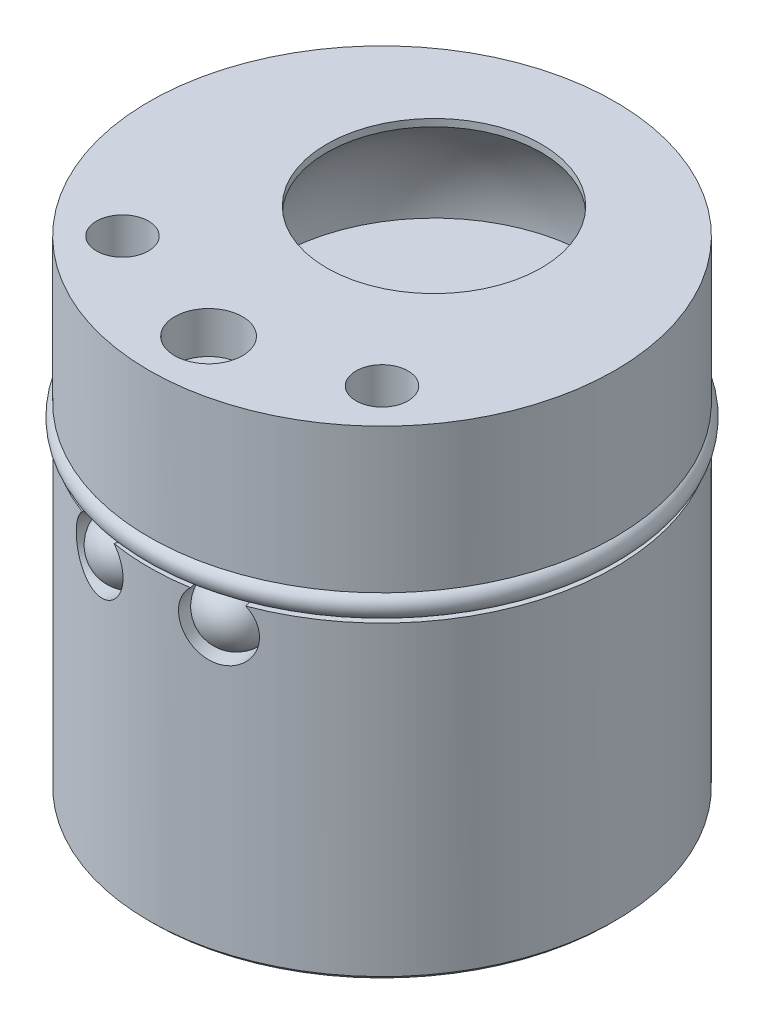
ISO-10303-21;
HEADER;
FILE_DESCRIPTION(('STEP AP214'),'2;1');
FILE_NAME('part.step','',(''),(''),'','','');
FILE_SCHEMA(('AUTOMOTIVE_DESIGN { 1 0 10303 214 1 1 1 1 }'));
ENDSEC;
DATA;
#1=APPLICATION_CONTEXT('core data for automotive mechanical design processes');
#2=APPLICATION_PROTOCOL_DEFINITION('international standard','automotive_design',2000,#1);
#3=PRODUCT_CONTEXT('',#1,'mechanical');
#4=PRODUCT('Part','Part','',(#3));
#5=PRODUCT_RELATED_PRODUCT_CATEGORY('part','',(#4));
#6=PRODUCT_DEFINITION_FORMATION('','',#4);
#7=PRODUCT_DEFINITION_CONTEXT('part definition',#1,'design');
#8=PRODUCT_DEFINITION('design','',#6,#7);
#9=PRODUCT_DEFINITION_SHAPE('','',#8);
#10=(LENGTH_UNIT() NAMED_UNIT(*) SI_UNIT(.MILLI.,.METRE.));
#11=(NAMED_UNIT(*) PLANE_ANGLE_UNIT() SI_UNIT($,.RADIAN.));
#12=(NAMED_UNIT(*) SI_UNIT($,.STERADIAN.) SOLID_ANGLE_UNIT());
#13=UNCERTAINTY_MEASURE_WITH_UNIT(LENGTH_MEASURE(1.E-05),#10,'distance_accuracy_value','');
#14=(GEOMETRIC_REPRESENTATION_CONTEXT(3) GLOBAL_UNCERTAINTY_ASSIGNED_CONTEXT((#13)) GLOBAL_UNIT_ASSIGNED_CONTEXT((#10,
#11,#12)) REPRESENTATION_CONTEXT('',''));
#15=CARTESIAN_POINT('',(0.,0.,0.));
#16=DIRECTION('',(0.,0.,1.));
#17=DIRECTION('',(1.,0.,0.));
#18=AXIS2_PLACEMENT_3D('',#15,#16,#17);
#19=CARTESIAN_POINT('',(3.254131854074,17.4752,12.1445854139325));
#20=DIRECTION('',(0.,-1.,0.));
#21=DIRECTION('',(0.965925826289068,0.,-0.258819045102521));
#22=AXIS2_PLACEMENT_3D('',#19,#20,#21);
#23=SPHERICAL_SURFACE('',#22,1.9812);
#24=CARTESIAN_POINT('',(3.25413185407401,15.494,12.1445854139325));
#25=VERTEX_POINT('',#24);
#26=VERTEX_LOOP('',#25);
#27=FACE_BOUND('',#26,.T.);
#28=ADVANCED_FACE('F35',(#27),#23,.T.);
#29=CLOSED_SHELL('',(#28));
#30=MANIFOLD_SOLID_BREP('B2',#29);
#31=CARTESIAN_POINT('',(-3.254131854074,17.4752,12.1445854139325));
#32=DIRECTION('',(0.,-1.,0.));
#33=DIRECTION('',(0.965925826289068,0.,0.258819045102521));
#34=AXIS2_PLACEMENT_3D('',#31,#32,#33);
#35=SPHERICAL_SURFACE('',#34,1.9812);
#36=CARTESIAN_POINT('',(-3.25413185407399,15.494,12.1445854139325));
#37=VERTEX_POINT('',#36);
#38=VERTEX_LOOP('',#37);
#39=FACE_BOUND('',#38,.T.);
#40=ADVANCED_FACE('F57',(#39),#35,.T.);
#41=CLOSED_SHELL('',(#40));
#42=MANIFOLD_SOLID_BREP('B6',#41);
#43=CARTESIAN_POINT('',(0.,19.7992999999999,0.));
#44=DIRECTION('',(0.,-1.,0.));
#45=DIRECTION('',(1.,0.,0.));
#46=AXIS2_PLACEMENT_3D('',#43,#44,#45);
#47=TOROIDAL_SURFACE('',#46,13.7668000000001,0.7493);
#48=CARTESIAN_POINT('',(5.63213611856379,19.3502649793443,13.2166420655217));
#49=CARTESIAN_POINT('',(5.57234835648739,19.3386718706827,13.2326621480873));
#50=CARTESIAN_POINT('',(5.51236971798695,19.3282071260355,13.2487333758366));
#51=CARTESIAN_POINT('',(5.39214961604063,19.3091634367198,13.2809462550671));
#52=CARTESIAN_POINT('',(5.3319082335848,19.3005839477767,13.2970878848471));
#53=CARTESIAN_POINT('',(5.21131645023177,19.284942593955,13.3294003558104));
#54=CARTESIAN_POINT('',(5.15096625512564,19.2778789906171,13.3455711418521));
#55=CARTESIAN_POINT('',(5.03013590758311,19.2650206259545,13.3779475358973));
#56=CARTESIAN_POINT('',(4.96965574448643,19.2592259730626,13.3941531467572));
#57=CARTESIAN_POINT('',(4.7885678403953,19.243498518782,13.4426755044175));
#58=CARTESIAN_POINT('',(4.66783037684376,19.2351630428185,13.4750270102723));
#59=CARTESIAN_POINT('',(4.42613387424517,19.2217888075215,13.539789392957));
#60=CARTESIAN_POINT('',(4.30517475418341,19.216751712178,13.5722002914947));
#61=CARTESIAN_POINT('',(4.0820265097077,19.2100275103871,13.6319926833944));
#62=CARTESIAN_POINT('',(3.97984825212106,19.2079408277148,13.6593712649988));
#63=CARTESIAN_POINT('',(3.77547265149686,19.205601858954,13.7141335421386));
#64=CARTESIAN_POINT('',(3.67327530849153,19.2053495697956,13.7415172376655));
#65=CARTESIAN_POINT('',(3.46894034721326,19.2066602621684,13.7962686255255));
#66=CARTESIAN_POINT('',(3.36680272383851,19.2082223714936,13.8236363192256));
#67=CARTESIAN_POINT('',(3.16256391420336,19.2132734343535,13.8783619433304));
#68=CARTESIAN_POINT('',(3.06046273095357,19.2167625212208,13.9057198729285));
#69=CARTESIAN_POINT('',(2.85565920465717,19.2259557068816,13.9605968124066));
#70=CARTESIAN_POINT('',(2.75295746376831,19.231674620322,13.9881156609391));
#71=CARTESIAN_POINT('',(2.54774262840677,19.2457759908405,14.0431028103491));
#72=CARTESIAN_POINT('',(2.4452294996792,19.2541579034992,14.0705711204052));
#73=CARTESIAN_POINT('',(2.24037468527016,19.2743132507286,14.1254618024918));
#74=CARTESIAN_POINT('',(2.13803335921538,19.2860907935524,14.1528840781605));
#75=CARTESIAN_POINT('',(1.98492612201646,19.3071959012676,14.1939090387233));
#76=CARTESIAN_POINT('',(1.93394057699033,19.3148072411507,14.2075705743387));
#77=CARTESIAN_POINT('',(1.83217256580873,19.3314264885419,14.2348392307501));
#78=CARTESIAN_POINT('',(1.78139014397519,19.3404346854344,14.2484463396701));
#79=CARTESIAN_POINT('',(1.73074807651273,19.3502649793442,14.2620158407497));
#80=B_SPLINE_CURVE_WITH_KNOTS('',3,(#48,#49,#50,#51,#52,#53,#54,#55,#56,#57,#58,#59,#60,#61,#62,
#63,#64,#65,#66,#67,#68,#69,#70,#71,#72,#73,#74,#75,#76,#77,#78,#79),.UNSPECIFIED.,.F.,.F.,(4,2,
2,2,2,2,2,2,2,2,2,2,2,2,2,4),(0.,0.188889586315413,0.377724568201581,0.566341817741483,
0.754975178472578,1.13073435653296,1.50668295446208,1.82407637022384,2.14146925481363,
2.45870962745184,2.77597195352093,3.09537906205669,3.41472091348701,3.73445075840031,
3.89442444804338,4.05443132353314),.UNSPECIFIED.);
#81=CARTESIAN_POINT('',(4.63979198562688,19.2339488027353,13.4825398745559));
#82=VERTEX_POINT('',#81);
#83=CARTESIAN_POINT('',(2.72309220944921,19.2339488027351,13.9961180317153));
#84=VERTEX_POINT('',#83);
#85=EDGE_CURVE('E95',#82,#84,#80,.T.);
#86=ORIENTED_EDGE('',*,*,#85,.F.);
#87=CARTESIAN_POINT('',(2.33512566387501,19.1182840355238,13.2500898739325));
#88=CARTESIAN_POINT('',(2.34735487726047,19.1332340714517,13.2148639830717));
#89=CARTESIAN_POINT('',(2.36338233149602,19.1498317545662,13.1815793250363));
#90=CARTESIAN_POINT('',(2.40159949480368,19.184364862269,13.1194508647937));
#91=CARTESIAN_POINT('',(2.42382443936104,19.2023074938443,13.0906339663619));
#92=CARTESIAN_POINT('',(2.4809008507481,19.2437678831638,13.028545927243));
#93=CARTESIAN_POINT('',(2.51750982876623,19.2672070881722,12.9968598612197));
#94=CARTESIAN_POINT('',(2.59621430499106,19.3116566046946,12.9392672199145));
#95=CARTESIAN_POINT('',(2.63831647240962,19.3326639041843,12.9133677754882));
#96=CARTESIAN_POINT('',(2.71836898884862,19.3678273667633,12.8699899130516));
#97=CARTESIAN_POINT('',(2.75572055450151,19.3825372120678,12.8518334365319));
#98=CARTESIAN_POINT('',(2.8322753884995,19.4093986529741,12.8176088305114));
#99=CARTESIAN_POINT('',(2.87147980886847,19.4215486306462,12.8015420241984));
#100=CARTESIAN_POINT('',(2.9512548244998,19.443136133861,12.7709423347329));
#101=CARTESIAN_POINT('',(2.99182686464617,19.4525706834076,12.7564111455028));
#102=CARTESIAN_POINT('',(3.07391707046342,19.4686268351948,12.7285092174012));
#103=CARTESIAN_POINT('',(3.11543535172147,19.4752480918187,12.7151386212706));
#104=CARTESIAN_POINT('',(3.20153515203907,19.4859303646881,12.6885611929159));
#105=CARTESIAN_POINT('',(3.24615466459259,19.4898206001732,12.6754088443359));
#106=CARTESIAN_POINT('',(3.33581392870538,19.4943716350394,12.6499933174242));
#107=CARTESIAN_POINT('',(3.38085372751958,19.4950320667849,12.6377302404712));
#108=CARTESIAN_POINT('',(3.47110612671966,19.4931185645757,12.6141250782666));
#109=CARTESIAN_POINT('',(3.51631872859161,19.4905446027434,12.6027830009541));
#110=CARTESIAN_POINT('',(3.60670777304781,19.4821791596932,12.5812128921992));
#111=CARTESIAN_POINT('',(3.65188422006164,19.4763881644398,12.5709846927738));
#112=CARTESIAN_POINT('',(3.73628857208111,19.4625725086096,12.5532169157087));
#113=CARTESIAN_POINT('',(3.77554144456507,19.4549261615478,12.5455008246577));
#114=CARTESIAN_POINT('',(3.85377815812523,19.4372706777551,12.5315615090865));
#115=CARTESIAN_POINT('',(3.89276204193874,19.4272619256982,12.5253380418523));
#116=CARTESIAN_POINT('',(3.9702865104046,19.4049894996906,12.5148854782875));
#117=CARTESIAN_POINT('',(4.00882773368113,19.392729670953,12.5106530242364));
#118=CARTESIAN_POINT('',(4.0853637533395,19.3661084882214,12.5048190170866));
#119=CARTESIAN_POINT('',(4.12335888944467,19.3517485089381,12.503215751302));
#120=CARTESIAN_POINT('',(4.20289726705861,19.3194511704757,12.5034778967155));
#121=CARTESIAN_POINT('',(4.24435305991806,19.3012927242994,12.5057581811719));
#122=CARTESIAN_POINT('',(4.32582336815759,19.2633796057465,12.5160520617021));
#123=CARTESIAN_POINT('',(4.36583959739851,19.2436269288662,12.5240585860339));
#124=CARTESIAN_POINT('',(4.43496251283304,19.2081699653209,12.5448683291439));
#125=CARTESIAN_POINT('',(4.46452996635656,19.1925328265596,12.5562256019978));
#126=CARTESIAN_POINT('',(4.52152958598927,19.1619970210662,12.5841459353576));
#127=CARTESIAN_POINT('',(4.54896493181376,19.147097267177,12.6007010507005));
#128=CARTESIAN_POINT('',(4.59559529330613,19.1220504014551,12.6355170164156));
#129=CARTESIAN_POINT('',(4.61534222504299,19.1115481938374,12.6527783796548));
#130=CARTESIAN_POINT('',(4.6523142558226,19.092517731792,12.6907637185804));
#131=CARTESIAN_POINT('',(4.66954055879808,19.0839885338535,12.711486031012));
#132=CARTESIAN_POINT('',(4.70100201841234,19.0695127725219,12.7560621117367));
#133=CARTESIAN_POINT('',(4.71522298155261,19.0635783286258,12.7799299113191));
#134=CARTESIAN_POINT('',(4.74013089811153,19.0547961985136,12.8299695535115));
#135=CARTESIAN_POINT('',(4.7508180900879,19.0519483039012,12.8561412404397));
#136=CARTESIAN_POINT('',(4.76772864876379,19.0495734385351,12.9078091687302));
#137=CARTESIAN_POINT('',(4.77423011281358,19.0498099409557,12.9332049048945));
#138=CARTESIAN_POINT('',(4.7839441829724,19.0529171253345,12.9844500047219));
#139=CARTESIAN_POINT('',(4.78715676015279,19.0557878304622,13.010299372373));
#140=CARTESIAN_POINT('',(4.79041950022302,19.0640504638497,13.0628973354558));
#141=CARTESIAN_POINT('',(4.7903316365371,19.0695429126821,13.0896382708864));
#142=CARTESIAN_POINT('',(4.78682460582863,19.082638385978,13.1423648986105));
#143=CARTESIAN_POINT('',(4.7834037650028,19.0902424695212,13.1683502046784));
#144=CARTESIAN_POINT('',(4.77151710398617,19.1103626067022,13.2290965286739));
#145=CARTESIAN_POINT('',(4.76160364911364,19.1236375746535,13.2633257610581));
#146=CARTESIAN_POINT('',(4.73652960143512,19.152042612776,13.3289718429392));
#147=CARTESIAN_POINT('',(4.72135988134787,19.1671758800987,13.3603836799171));
#148=CARTESIAN_POINT('',(4.6804376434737,19.2036168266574,13.4307088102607));
#149=CARTESIAN_POINT('',(4.65283948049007,19.2252278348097,13.4683869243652));
#150=CARTESIAN_POINT('',(4.59128537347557,19.2677257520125,13.5385562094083));
#151=CARTESIAN_POINT('',(4.55731936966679,19.2886114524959,13.5710390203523));
#152=CARTESIAN_POINT('',(4.46865859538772,19.3369525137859,13.6446888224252));
#153=CARTESIAN_POINT('',(4.41138397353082,19.3633005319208,13.6834648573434));
#154=CARTESIAN_POINT('',(4.29019628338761,19.4094633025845,13.7538815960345));
#155=CARTESIAN_POINT('',(4.22627102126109,19.4292657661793,13.7855088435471));
#156=CARTESIAN_POINT('',(4.11770094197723,19.4556183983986,13.8329462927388));
#157=CARTESIAN_POINT('',(4.07427151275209,19.4643774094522,13.8503847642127));
#158=CARTESIAN_POINT('',(3.9861104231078,19.4786330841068,13.8832319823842));
#159=CARTESIAN_POINT('',(3.94137841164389,19.4841288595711,13.898640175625));
#160=CARTESIAN_POINT('',(3.85100085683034,19.4917806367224,13.9275786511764));
#161=CARTESIAN_POINT('',(3.80535471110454,19.4939343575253,13.9411076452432));
#162=CARTESIAN_POINT('',(3.71348911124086,19.4948707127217,13.9662903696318));
#163=CARTESIAN_POINT('',(3.66726938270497,19.4936516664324,13.9779431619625));
#164=CARTESIAN_POINT('',(3.57424145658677,19.4878319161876,13.9993069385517));
#165=CARTESIAN_POINT('',(3.52743141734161,19.4832069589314,14.0090033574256));
#166=CARTESIAN_POINT('',(3.43385846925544,19.4706109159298,14.026052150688));
#167=CARTESIAN_POINT('',(3.38709554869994,19.4626417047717,14.0334058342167));
#168=CARTESIAN_POINT('',(3.29394053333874,19.4434909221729,14.0453142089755));
#169=CARTESIAN_POINT('',(3.24754797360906,19.4323143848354,14.0498732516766));
#170=CARTESIAN_POINT('',(3.15540009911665,19.4069643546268,14.0555850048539));
#171=CARTESIAN_POINT('',(3.1096443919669,19.3927928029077,14.0567399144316));
#172=CARTESIAN_POINT('',(3.00980105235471,19.3586069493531,14.0546643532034));
#173=CARTESIAN_POINT('',(2.95593048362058,19.3379904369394,14.0504853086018));
#174=CARTESIAN_POINT('',(2.85055235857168,19.2939659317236,14.0343201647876));
#175=CARTESIAN_POINT('',(2.79904103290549,19.2705626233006,14.0223470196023));
#176=CARTESIAN_POINT('',(2.71198386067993,19.2287335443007,13.9928822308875));
#177=CARTESIAN_POINT('',(2.67563935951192,19.2105076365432,13.9774867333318));
#178=CARTESIAN_POINT('',(2.60586292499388,19.1747480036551,13.9404730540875));
#179=CARTESIAN_POINT('',(2.57242741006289,19.1572134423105,13.9188626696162));
#180=CARTESIAN_POINT('',(2.51657308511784,19.1280963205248,13.8745714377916));
#181=CARTESIAN_POINT('',(2.49335827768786,19.1160574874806,13.8531984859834));
#182=CARTESIAN_POINT('',(2.45000925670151,19.0942751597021,13.806504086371));
#183=CARTESIAN_POINT('',(2.42987184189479,19.0845292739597,13.7811867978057));
#184=CARTESIAN_POINT('',(2.39619394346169,19.0694929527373,13.7311101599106));
#185=CARTESIAN_POINT('',(2.38211609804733,19.0637508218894,13.7068491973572));
#186=CARTESIAN_POINT('',(2.35720708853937,19.0550889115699,13.6562336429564));
#187=CARTESIAN_POINT('',(2.34637459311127,19.0521679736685,13.6298799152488));
#188=CARTESIAN_POINT('',(2.32839241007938,19.0494977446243,13.5756435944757));
#189=CARTESIAN_POINT('',(2.32125963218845,19.0497628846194,13.5477546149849));
#190=CARTESIAN_POINT('',(2.3111451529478,19.0536075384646,13.4914478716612));
#191=CARTESIAN_POINT('',(2.30816322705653,19.0571868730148,13.4630301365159));
#192=CARTESIAN_POINT('',(2.3066092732,19.0670084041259,13.4089857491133));
#193=CARTESIAN_POINT('',(2.30769247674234,19.0730055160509,13.3833228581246));
#194=CARTESIAN_POINT('',(2.31346786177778,19.0871956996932,13.3330704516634));
#195=CARTESIAN_POINT('',(2.31815454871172,19.0953854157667,13.3084793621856));
#196=CARTESIAN_POINT('',(2.32765006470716,19.1088351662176,13.2729564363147));
#197=CARTESIAN_POINT('',(2.33119130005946,19.1134743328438,13.2614226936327));
#198=CARTESIAN_POINT('',(2.33512566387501,19.1182840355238,13.2500898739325));
#199=B_SPLINE_CURVE_WITH_KNOTS('',3,(#87,#88,#89,#90,#91,#92,#93,#94,#95,#96,#97,#98,#99,#100,
#101,#102,#103,#104,#105,#106,#107,#108,#109,#110,#111,#112,#113,#114,#115,#116,#117,#118,#119,
#120,#121,#122,#123,#124,#125,#126,#127,#128,#129,#130,#131,#132,#133,#134,#135,#136,#137,#138,
#139,#140,#141,#142,#143,#144,#145,#146,#147,#148,#149,#150,#151,#152,#153,#154,#155,#156,#157,
#158,#159,#160,#161,#162,#163,#164,#165,#166,#167,#168,#169,#170,#171,#172,#173,#174,#175,#176,
#177,#178,#179,#180,#181,#182,#183,#184,#185,#186,#187,#188,#189,#190,#191,#192,#193,#194,#195,
#196,#197,#198),.UNSPECIFIED.,.T.,.F.,(4,2,2,2,2,2,2,2,2,2,2,2,2,2,2,2,2,2,2,2,2,2,2,2,2,2,2,2,
2,2,2,2,2,2,2,2,2,2,2,2,2,2,2,2,2,2,2,2,2,2,2,2,2,2,2,4),(0.,0.120471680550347,
0.241642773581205,0.402100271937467,0.562754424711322,0.694755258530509,0.826839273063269,
0.959067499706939,1.09131196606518,1.23122712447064,1.37115820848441,1.51109049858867,
1.65100165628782,1.77309747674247,1.89517342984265,2.01704276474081,2.13883268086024,
2.27446242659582,2.40992496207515,2.51553434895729,2.6209830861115,2.70539105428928,
2.78975857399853,2.87451605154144,2.95926780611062,3.03756122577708,3.11585533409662,
3.19742725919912,3.27904017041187,3.39249594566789,3.50614972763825,3.65968208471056,
3.81345906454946,4.03430164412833,4.25555651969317,4.39823401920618,4.54095033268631,
4.68376400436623,4.8266488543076,4.97056113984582,5.11439286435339,5.25800005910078,
5.40151446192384,5.57447990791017,5.74715861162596,5.87714630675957,6.00697162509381,
6.10791240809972,6.20874746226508,6.29428014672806,6.37977769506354,6.46566264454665,
6.55154294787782,6.63031077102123,6.70895872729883,6.74771669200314),.UNSPECIFIED.);
#200=EDGE_CURVE('E109',#84,#82,#199,.T.);
#201=ORIENTED_EDGE('',*,*,#200,.F.);
#202=EDGE_LOOP('',(#86,#201));
#203=FACE_BOUND('',#202,.T.);
#204=CARTESIAN_POINT('',(-1.73074807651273,19.3502649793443,14.2620158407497));
#205=CARTESIAN_POINT('',(-1.79053583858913,19.3386718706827,14.2459957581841));
#206=CARTESIAN_POINT('',(-1.85051447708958,19.3282071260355,14.2299245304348));
#207=CARTESIAN_POINT('',(-1.9707345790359,19.3091634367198,14.1977116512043));
#208=CARTESIAN_POINT('',(-2.03097596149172,19.3005839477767,14.1815700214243));
#209=CARTESIAN_POINT('',(-2.15156774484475,19.284942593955,14.149257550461));
#210=CARTESIAN_POINT('',(-2.21191793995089,19.2778789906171,14.1330867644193));
#211=CARTESIAN_POINT('',(-2.33274828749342,19.2650206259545,14.1007103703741));
#212=CARTESIAN_POINT('',(-2.39322845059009,19.2592259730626,14.0845047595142));
#213=CARTESIAN_POINT('',(-2.57431635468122,19.243498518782,14.035982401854));
#214=CARTESIAN_POINT('',(-2.69505381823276,19.2351630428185,14.0036308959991));
#215=CARTESIAN_POINT('',(-2.93675032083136,19.2217888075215,13.9388685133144));
#216=CARTESIAN_POINT('',(-3.05770944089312,19.216751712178,13.9064576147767));
#217=CARTESIAN_POINT('',(-3.28085768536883,19.2100275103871,13.846665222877));
#218=CARTESIAN_POINT('',(-3.38303594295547,19.2079408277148,13.8192866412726));
#219=CARTESIAN_POINT('',(-3.58741154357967,19.205601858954,13.7645243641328));
#220=CARTESIAN_POINT('',(-3.689608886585,19.2053495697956,13.7371406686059));
#221=CARTESIAN_POINT('',(-3.89394384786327,19.2066602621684,13.6823892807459));
#222=CARTESIAN_POINT('',(-3.99608147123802,19.2082223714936,13.6550215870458));
#223=CARTESIAN_POINT('',(-4.20032028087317,19.2132734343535,13.600295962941));
#224=CARTESIAN_POINT('',(-4.30242146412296,19.2167625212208,13.5729380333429));
#225=CARTESIAN_POINT('',(-4.50722499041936,19.2259557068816,13.5180610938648));
#226=CARTESIAN_POINT('',(-4.60992673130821,19.231674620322,13.4905422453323));
#227=CARTESIAN_POINT('',(-4.81514156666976,19.2457759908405,13.4355550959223));
#228=CARTESIAN_POINT('',(-4.91765469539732,19.2541579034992,13.4080867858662));
#229=CARTESIAN_POINT('',(-5.12250950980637,19.2743132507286,13.3531961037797));
#230=CARTESIAN_POINT('',(-5.22485083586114,19.2860907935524,13.325773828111));
#231=CARTESIAN_POINT('',(-5.37795807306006,19.3071959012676,13.2847488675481));
#232=CARTESIAN_POINT('',(-5.4289436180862,19.3148072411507,13.2710873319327));
#233=CARTESIAN_POINT('',(-5.5307116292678,19.3314264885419,13.2438186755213));
#234=CARTESIAN_POINT('',(-5.58149405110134,19.3404346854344,13.2302115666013));
#235=CARTESIAN_POINT('',(-5.63213611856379,19.3502649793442,13.2166420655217));
#236=B_SPLINE_CURVE_WITH_KNOTS('',3,(#204,#205,#206,#207,#208,#209,#210,#211,#212,#213,#214,
#215,#216,#217,#218,#219,#220,#221,#222,#223,#224,#225,#226,#227,#228,#229,#230,#231,#232,#233,
#234,#235),.UNSPECIFIED.,.F.,.F.,(4,2,2,2,2,2,2,2,2,2,2,2,2,2,2,4),(0.,0.188889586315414,
0.377724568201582,0.566341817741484,0.754975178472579,1.13073435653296,1.50668295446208,
1.82407637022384,2.14146925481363,2.45870962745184,2.77597195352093,3.09537906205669,
3.41472091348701,3.73445075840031,3.89442444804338,4.05443132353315),.UNSPECIFIED.);
#237=CARTESIAN_POINT('',(-2.72309220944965,19.2339488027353,13.9961180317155));
#238=VERTEX_POINT('',#237);
#239=CARTESIAN_POINT('',(-4.63979198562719,19.233948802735,13.4825398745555));
#240=VERTEX_POINT('',#239);
#241=EDGE_CURVE('E55',#238,#240,#236,.T.);
#242=ORIENTED_EDGE('',*,*,#241,.F.);
#243=CARTESIAN_POINT('',(-4.60276679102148,19.1182840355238,12.64247726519));
#244=CARTESIAN_POINT('',(-4.574563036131,19.1332340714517,12.6180853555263));
#245=CARTESIAN_POINT('',(-4.54404052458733,19.1498317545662,12.5972737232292));
#246=CARTESIAN_POINT('',(-4.47987926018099,19.184364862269,12.5625774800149));
#247=CARTESIAN_POINT('',(-4.44622344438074,19.2023074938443,12.5487337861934));
#248=CARTESIAN_POINT('',(-4.36574980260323,19.2437678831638,12.5235021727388));
#249=CARTESIAN_POINT('',(-4.31820246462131,19.2672070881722,12.5143657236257));
#250=CARTESIAN_POINT('',(-4.22124606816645,19.3116566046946,12.5038412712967));
#251=CARTESIAN_POINT('',(-4.17183479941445,19.3326639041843,12.502462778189));
#252=CARTESIAN_POINT('',(-4.08081835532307,19.3678273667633,12.5049227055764));
#253=CARTESIAN_POINT('',(-4.0393927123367,19.3825372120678,12.5078745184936));
#254=CARTESIAN_POINT('',(-3.9559819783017,19.4093986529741,12.5165125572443));
#255=CARTESIAN_POINT('',(-3.91399655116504,19.4215486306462,12.5222005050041));
#256=CARTESIAN_POINT('',(-3.82960951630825,19.443136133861,12.5355879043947));
#257=CARTESIAN_POINT('',(-3.78720750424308,19.4525706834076,12.5432895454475));
#258=CARTESIAN_POINT('',(-3.70216433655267,19.4686268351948,12.5601708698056));
#259=CARTESIAN_POINT('',(-3.65952315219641,19.4752480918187,12.5693507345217));
#260=CARTESIAN_POINT('',(-3.57166982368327,19.4859303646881,12.5893839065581));
#261=CARTESIAN_POINT('',(-3.52645201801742,19.4898206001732,12.6003033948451));
#262=CARTESIAN_POINT('',(-3.43609705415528,19.4943716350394,12.6231225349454));
#263=CARTESIAN_POINT('',(-3.39095990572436,19.4950320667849,12.6350222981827));
#264=CARTESIAN_POINT('',(-3.3009964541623,19.4931185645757,12.6597058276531));
#265=CARTESIAN_POINT('',(-3.25617015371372,19.4905446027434,12.6724896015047));
#266=CARTESIAN_POINT('',(-3.16710589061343,19.4821791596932,12.6990038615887));
#267=CARTESIAN_POINT('',(-3.122867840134,19.4763881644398,12.7127342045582));
#268=CARTESIAN_POINT('',(-3.04088763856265,19.4625725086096,12.7395490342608));
#269=CARTESIAN_POINT('',(-3.00303560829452,19.4549261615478,12.7524931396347));
#270=CARTESIAN_POINT('',(-2.92831096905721,19.4372706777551,12.7795396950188));
#271=CARTESIAN_POINT('',(-2.89143820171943,19.4272619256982,12.7936419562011));
#272=CARTESIAN_POINT('',(-2.81907376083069,19.4049894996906,12.8233520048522));
#273=CARTESIAN_POINT('',(-2.78357985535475,19.392729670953,12.8389572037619));
#274=CARTESIAN_POINT('',(-2.71438071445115,19.3661084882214,12.8721728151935));
#275=CARTESIAN_POINT('',(-2.68067432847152,19.3517485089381,12.8897819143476));
#276=CARTESIAN_POINT('',(-2.61192314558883,19.3194511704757,12.9297781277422));
#277=CARTESIAN_POINT('',(-2.57716151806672,19.3012927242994,12.952480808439));
#278=CARTESIAN_POINT('',(-2.51175310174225,19.2633796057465,13.0021307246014));
#279=CARTESIAN_POINT('',(-2.48110129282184,19.2436269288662,13.0290726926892));
#280=CARTESIAN_POINT('',(-2.43164396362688,19.2081699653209,13.081655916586));
#281=CARTESIAN_POINT('',(-2.41171643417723,19.1925328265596,13.1062753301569));
#282=CARTESIAN_POINT('',(-2.37631348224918,19.1619970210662,13.158954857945));
#283=CARTESIAN_POINT('',(-2.36083133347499,19.147097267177,13.1870096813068));
#284=CARTESIAN_POINT('',(-2.3378562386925,19.1220504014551,13.2404763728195));
#285=CARTESIAN_POINT('',(-2.32938557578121,19.1115481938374,13.2652986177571));
#286=CARTESIAN_POINT('',(-2.31635952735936,19.092517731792,13.3166809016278));
#287=CARTESIAN_POINT('',(-2.31180226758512,19.0839885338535,13.3432401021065));
#288=CARTESIAN_POINT('',(-2.30684388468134,19.0695127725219,13.3975748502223));
#289=CARTESIAN_POINT('',(-2.30646206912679,19.0635783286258,13.4253554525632));
#290=CARTESIAN_POINT('',(-2.30991100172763,19.0547961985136,13.4811450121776));
#291=CARTESIAN_POINT('',(-2.31374146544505,19.0519483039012,13.5091539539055));
#292=CARTESIAN_POINT('',(-2.32493045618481,19.0495734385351,13.5623549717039));
#293=CARTESIAN_POINT('',(-2.33199789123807,19.0498099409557,13.5875990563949));
#294=CARTESIAN_POINT('',(-2.34920780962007,19.0529171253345,13.6368356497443));
#295=CARTESIAN_POINT('',(-2.35935031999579,19.0557878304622,13.6608281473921));
#296=CARTESIAN_POINT('',(-2.38282368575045,19.0640504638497,13.7080106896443));
#297=CARTESIAN_POINT('',(-2.3962702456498,19.0695429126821,13.7311250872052));
#298=CARTESIAN_POINT('',(-2.42567073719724,19.082638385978,13.7750341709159));
#299=CARTESIAN_POINT('',(-2.44162592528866,19.0902424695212,13.7958276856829));
#300=CARTESIAN_POINT('',(-2.48229323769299,19.1103626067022,13.8424922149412));
#301=CARTESIAN_POINT('',(-2.50799315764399,19.1236375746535,13.8671788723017));
#302=CARTESIAN_POINT('',(-2.5625309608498,19.152042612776,13.9114930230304));
#303=CARTESIAN_POINT('',(-2.59137424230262,19.1671758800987,13.9311116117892));
#304=CARTESIAN_POINT('',(-2.66197650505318,19.2036168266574,13.9715538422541));
#305=CARTESIAN_POINT('',(-2.704716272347,19.2252278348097,13.9903849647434));
#306=CARTESIAN_POINT('',(-2.79310833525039,19.2677257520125,14.0203762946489));
#307=CARTESIAN_POINT('',(-2.83876516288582,19.2886114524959,14.0315242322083));
#308=CARTESIAN_POINT('',(-2.95237254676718,19.3369525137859,14.0509764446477));
#309=CARTESIAN_POINT('',(-3.02136184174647,19.3633005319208,14.0559201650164));
#310=CARTESIAN_POINT('',(-3.16152182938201,19.4094633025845,14.0563090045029));
#311=CARTESIAN_POINT('',(-3.23269635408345,19.4292657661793,14.0517363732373));
#312=CARTESIAN_POINT('',(-3.35043952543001,19.4556183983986,14.0385333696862));
#313=CARTESIAN_POINT('',(-3.39676975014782,19.4643774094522,14.0319208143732));
#314=CARTESIAN_POINT('',(-3.4895431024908,19.4786330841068,14.0162867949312));
#315=CARTESIAN_POINT('',(-3.53598625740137,19.4841288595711,14.0072646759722));
#316=CARTESIAN_POINT('',(-3.62872475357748,19.4917806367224,13.9871373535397));
#317=CARTESIAN_POINT('',(-3.6750199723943,19.4939343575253,13.9760307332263));
#318=CARTESIAN_POINT('',(-3.76716927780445,19.4948707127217,13.9519068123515));
#319=CARTESIAN_POINT('',(-3.81302313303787,19.4936516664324,13.938888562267));
#320=CARTESIAN_POINT('',(-3.90426956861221,19.4878319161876,13.9108761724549));
#321=CARTESIAN_POINT('',(-3.94965646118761,19.4832069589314,13.8958684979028));
#322=CARTESIAN_POINT('',(-4.03921740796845,19.4706109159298,13.8638467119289));
#323=CARTESIAN_POINT('',(-4.08339212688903,19.4626417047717,13.8468337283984));
#324=CARTESIAN_POINT('',(-4.17002092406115,19.4434909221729,13.8105691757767));
#325=CARTESIAN_POINT('',(-4.21247758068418,19.4323143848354,13.7913211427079));
#326=CARTESIAN_POINT('',(-4.29513585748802,19.4069643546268,13.7501937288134));
#327=CARTESIAN_POINT('',(-4.33533891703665,19.3927928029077,13.7283160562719));
#328=CARTESIAN_POINT('',(-4.4207680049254,19.3586069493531,13.6765968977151));
#329=CARTESIAN_POINT('',(-4.46533176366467,19.3379904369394,13.6460424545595));
#330=CARTESIAN_POINT('',(-4.54850932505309,19.2939659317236,13.5793539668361));
#331=CARTESIAN_POINT('',(-4.58713286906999,19.2705626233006,13.5432292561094));
#332=CARTESIAN_POINT('',(-4.64779419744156,19.2287335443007,13.4741834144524));
#333=CARTESIAN_POINT('',(-4.67157170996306,19.2105076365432,13.4426782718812));
#334=CARTESIAN_POINT('',(-4.71349303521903,19.1747480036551,13.3757352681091));
#335=CARTESIAN_POINT('',(-4.73164384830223,19.1572134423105,13.3403023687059));
#336=CARTESIAN_POINT('',(-4.7578694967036,19.1280963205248,13.2740178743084));
#337=CARTESIAN_POINT('',(-4.76728763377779,19.1160574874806,13.2439009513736));
#338=CARTESIAN_POINT('',(-4.78148178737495,19.0942751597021,13.1817879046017));
#339=CARTESIAN_POINT('',(-4.7862626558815,19.0845292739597,13.1497937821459));
#340=CARTESIAN_POINT('',(-4.79039025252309,19.0694929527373,13.089587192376));
#341=CARTESIAN_POINT('',(-4.79045154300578,19.0637508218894,13.0615376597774));
#342=CARTESIAN_POINT('',(-4.78671560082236,19.0550889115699,13.0052487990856));
#343=CARTESIAN_POINT('',(-4.78291995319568,19.0521679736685,12.9770095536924));
#344=CARTESIAN_POINT('',(-4.77137482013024,19.0494977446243,12.9210484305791));
#345=CARTESIAN_POINT('',(-4.76360749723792,19.0497628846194,12.893329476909));
#346=CARTESIAN_POINT('',(-4.74421352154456,19.0536075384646,12.839509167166));
#347=CARTESIAN_POINT('',(-4.73258707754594,19.0571868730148,12.8134077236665));
#348=CARTESIAN_POINT('',(-4.70691064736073,19.0670084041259,12.7658269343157));
#349=CARTESIAN_POINT('',(-4.6931411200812,19.0730055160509,12.744143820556));
#350=CARTESIAN_POINT('',(-4.6630132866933,19.0871956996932,12.7035116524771));
#351=CARTESIAN_POINT('',(-4.64665895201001,19.0953854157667,12.6845584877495));
#352=CARTESIAN_POINT('',(-4.62067413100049,19.1088351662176,12.6585424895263));
#353=CARTESIAN_POINT('',(-4.61184045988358,19.1134743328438,12.6503245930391));
#354=CARTESIAN_POINT('',(-4.60276679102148,19.1182840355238,12.64247726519));
#355=B_SPLINE_CURVE_WITH_KNOTS('',3,(#243,#244,#245,#246,#247,#248,#249,#250,#251,#252,#253,
#254,#255,#256,#257,#258,#259,#260,#261,#262,#263,#264,#265,#266,#267,#268,#269,#270,#271,#272,
#273,#274,#275,#276,#277,#278,#279,#280,#281,#282,#283,#284,#285,#286,#287,#288,#289,#290,#291,
#292,#293,#294,#295,#296,#297,#298,#299,#300,#301,#302,#303,#304,#305,#306,#307,#308,#309,#310,
#311,#312,#313,#314,#315,#316,#317,#318,#319,#320,#321,#322,#323,#324,#325,#326,#327,#328,#329,
#330,#331,#332,#333,#334,#335,#336,#337,#338,#339,#340,#341,#342,#343,#344,#345,#346,#347,#348,
#349,#350,#351,#352,#353,#354),.UNSPECIFIED.,.T.,.F.,(4,2,2,2,2,2,2,2,2,2,2,2,2,2,2,2,2,2,2,2,2,
2,2,2,2,2,2,2,2,2,2,2,2,2,2,2,2,2,2,2,2,2,2,2,2,2,2,2,2,2,2,2,2,2,2,4),(0.,0.120471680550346,
0.241642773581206,0.402100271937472,0.562754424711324,0.69475525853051,0.82683927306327,
0.959067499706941,1.09131196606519,1.23122712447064,1.37115820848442,1.51109049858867,
1.65100165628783,1.77309747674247,1.89517342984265,2.01704276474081,2.13883268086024,
2.27446242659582,2.40992496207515,2.51553434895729,2.6209830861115,2.70539105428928,
2.78975857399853,2.87451605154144,2.95926780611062,3.03756122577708,3.11585533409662,
3.19742725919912,3.27904017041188,3.39249594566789,3.50614972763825,3.65968208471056,
3.81345906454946,4.03430164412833,4.25555651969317,4.39823401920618,4.54095033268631,
4.68376400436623,4.8266488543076,4.97056113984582,5.11439286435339,5.25800005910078,
5.40151446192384,5.57447990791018,5.74715861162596,5.87714630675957,6.00697162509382,
6.10791240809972,6.20874746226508,6.29428014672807,6.37977769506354,6.46566264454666,
6.55154294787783,6.63031077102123,6.70895872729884,6.74771669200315),.UNSPECIFIED.);
#356=EDGE_CURVE('E89',#240,#238,#355,.T.);
#357=ORIENTED_EDGE('',*,*,#356,.F.);
#358=EDGE_LOOP('',(#242,#357));
#359=FACE_BOUND('',#358,.T.);
#360=ADVANCED_FACE('F78',(#203,#359),#47,.T.);
#361=CARTESIAN_POINT('',(-3.68144209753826,19.4945,13.7393289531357));
#362=DIRECTION('',(-0.258819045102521,0.,0.965925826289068));
#363=DIRECTION('',(0.965925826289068,0.,0.258819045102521));
#364=AXIS2_PLACEMENT_3D('',#361,#362,#363);
#365=PLANE('',#364);
#366=ORIENTED_EDGE('',*,*,#241,.T.);
#367=CARTESIAN_POINT('',(-3.68144209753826,17.4752,13.7393289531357));
#368=DIRECTION('',(-0.258819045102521,0.,0.965925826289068));
#369=DIRECTION('',(0.965925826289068,0.,0.258819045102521));
#370=AXIS2_PLACEMENT_3D('',#367,#368,#369);
#371=CIRCLE('',#370,2.01930000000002);
#372=EDGE_CURVE('E102',#238,#240,#371,.T.);
#373=ORIENTED_EDGE('',*,*,#372,.F.);
#374=EDGE_LOOP('',(#366,#373));
#375=FACE_BOUND('',#374,.T.);
#376=ADVANCED_FACE('F137',(#375),#365,.F.);
#377=CARTESIAN_POINT('',(-3.68144209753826,17.4752,13.7393289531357));
#378=DIRECTION('',(-0.258819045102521,0.,0.965925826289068));
#379=DIRECTION('',(0.965925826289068,0.,0.258819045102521));
#380=AXIS2_PLACEMENT_3D('',#377,#378,#379);
#381=CYLINDRICAL_SURFACE('',#380,2.01930000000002);
#382=ORIENTED_EDGE('',*,*,#356,.T.);
#383=ORIENTED_EDGE('',*,*,#372,.T.);
#384=EDGE_LOOP('',(#382,#383));
#385=FACE_BOUND('',#384,.T.);
#386=ADVANCED_FACE('F129',(#385),#381,.F.);
#387=CARTESIAN_POINT('',(3.68144209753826,19.4945,13.7393289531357));
#388=DIRECTION('',(0.258819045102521,0.,0.965925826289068));
#389=DIRECTION('',(0.965925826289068,0.,-0.258819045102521));
#390=AXIS2_PLACEMENT_3D('',#387,#388,#389);
#391=PLANE('',#390);
#392=ORIENTED_EDGE('',*,*,#85,.T.);
#393=CARTESIAN_POINT('',(3.68144209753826,17.4752,13.7393289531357));
#394=DIRECTION('',(0.258819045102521,0.,0.965925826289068));
#395=DIRECTION('',(0.965925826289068,0.,-0.258819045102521));
#396=AXIS2_PLACEMENT_3D('',#393,#394,#395);
#397=CIRCLE('',#396,2.01930000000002);
#398=EDGE_CURVE('E111',#82,#84,#397,.T.);
#399=ORIENTED_EDGE('',*,*,#398,.F.);
#400=EDGE_LOOP('',(#392,#399));
#401=FACE_BOUND('',#400,.T.);
#402=ADVANCED_FACE('F114',(#401),#391,.F.);
#403=CARTESIAN_POINT('',(3.68144209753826,17.4752,13.7393289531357));
#404=DIRECTION('',(0.258819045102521,0.,0.965925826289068));
#405=DIRECTION('',(0.965925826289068,0.,-0.258819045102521));
#406=AXIS2_PLACEMENT_3D('',#403,#404,#405);
#407=CYLINDRICAL_SURFACE('',#406,2.01930000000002);
#408=ORIENTED_EDGE('',*,*,#200,.T.);
#409=ORIENTED_EDGE('',*,*,#398,.T.);
#410=EDGE_LOOP('',(#408,#409));
#411=FACE_BOUND('',#410,.T.);
#412=ADVANCED_FACE('F110',(#411),#407,.F.);
#413=CLOSED_SHELL('',(#360,#376,#386,#402,#412));
#414=MANIFOLD_SOLID_BREP('B31',#413);
#415=CARTESIAN_POINT('',(14.224,18.9484,0.));
#416=DIRECTION('',(0.,-1.,0.));
#417=DIRECTION('',(1.,0.,0.));
#418=AXIS2_PLACEMENT_3D('',#415,#416,#417);
#419=PLANE('',#418);
#420=CARTESIAN_POINT('',(0.,18.9484,0.));
#421=DIRECTION('',(0.,-1.,0.));
#422=DIRECTION('',(1.,0.,0.));
#423=AXIS2_PLACEMENT_3D('',#420,#421,#422);
#424=CIRCLE('',#423,13.0175000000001);
#425=CARTESIAN_POINT('',(-4.68413905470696,18.9484,12.1455402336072));
#426=VERTEX_POINT('',#425);
#427=CARTESIAN_POINT('',(4.68413905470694,18.9484,12.1455402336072));
#428=VERTEX_POINT('',#427);
#429=EDGE_CURVE('E272',#426,#428,#424,.T.);
#430=ORIENTED_EDGE('',*,*,#429,.T.);
#431=DIRECTION('',(0.258819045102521,0.,0.965925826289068));
#432=VECTOR('',#431,1.);
#433=CARTESIAN_POINT('',(5.01541827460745,18.9483999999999,13.3818911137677));
#434=LINE('',#433,#432);
#435=CARTESIAN_POINT('',(4.99802504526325,18.9484,13.3169786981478));
#436=VERTEX_POINT('',#435);
#437=EDGE_CURVE('E260',#428,#436,#434,.T.);
#438=ORIENTED_EDGE('',*,*,#437,.T.);
#439=CARTESIAN_POINT('',(0.,18.9484,0.));
#440=DIRECTION('',(0.,-1.,0.));
#441=DIRECTION('',(1.,0.,0.));
#442=AXIS2_PLACEMENT_3D('',#439,#440,#441);
#443=CIRCLE('',#442,14.2240000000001);
#444=CARTESIAN_POINT('',(-4.99802504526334,18.9484,13.3169786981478));
#445=VERTEX_POINT('',#444);
#446=EDGE_CURVE('E270',#445,#436,#443,.T.);
#447=ORIENTED_EDGE('',*,*,#446,.F.);
#448=DIRECTION('',(-0.258819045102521,0.,0.965925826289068));
#449=VECTOR('',#448,1.);
#450=CARTESIAN_POINT('',(-5.01541827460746,18.9483999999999,13.3818911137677));
#451=LINE('',#450,#449);
#452=EDGE_CURVE('E206',#445,#426,#451,.F.);
#453=ORIENTED_EDGE('',*,*,#452,.T.);
#454=EDGE_LOOP('',(#430,#438,#447,#453));
#455=FACE_BOUND('',#454,.T.);
#456=ADVANCED_FACE('F179',(#455),#419,.F.);
#457=CARTESIAN_POINT('',(0.,29.3624,0.));
#458=DIRECTION('',(0.,-1.,0.));
#459=DIRECTION('',(0.,0.,-1.));
#460=AXIS2_PLACEMENT_3D('',#457,#458,#459);
#461=CYLINDRICAL_SURFACE('',#460,14.224);
#462=CARTESIAN_POINT('',(0.,20.5485999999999,0.));
#463=DIRECTION('',(0.,-1.,0.));
#464=DIRECTION('',(1.,0.,0.));
#465=AXIS2_PLACEMENT_3D('',#462,#463,#464);
#466=CIRCLE('',#465,14.2240000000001);
#467=CARTESIAN_POINT('',(14.224,20.5486,0.));
#468=VERTEX_POINT('',#467);
#469=EDGE_CURVE('E418',#468,#468,#466,.T.);
#470=ORIENTED_EDGE('',*,*,#469,.F.);
#471=EDGE_LOOP('',(#470));
#472=FACE_BOUND('',#471,.T.);
#473=CARTESIAN_POINT('',(0.,29.3624,0.));
#474=DIRECTION('',(0.,1.,0.));
#475=DIRECTION('',(0.,0.,1.));
#476=AXIS2_PLACEMENT_3D('',#473,#474,#475);
#477=CIRCLE('',#476,14.224);
#478=CARTESIAN_POINT('',(0.,29.3624,14.224));
#479=VERTEX_POINT('',#478);
#480=EDGE_CURVE('E363',#479,#479,#477,.T.);
#481=ORIENTED_EDGE('',*,*,#480,.F.);
#482=EDGE_LOOP('',(#481));
#483=FACE_BOUND('',#482,.T.);
#484=ADVANCED_FACE('F378',(#472,#483),#461,.T.);
#485=CARTESIAN_POINT('',(0.,29.3624,0.));
#486=DIRECTION('',(0.,1.,0.));
#487=DIRECTION('',(0.,0.,1.));
#488=AXIS2_PLACEMENT_3D('',#485,#486,#487);
#489=PLANE('',#488);
#490=CARTESIAN_POINT('',(0.,29.3623999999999,-3.175));
#491=DIRECTION('',(0.,-1.,0.));
#492=DIRECTION('',(0.,0.,-1.));
#493=AXIS2_PLACEMENT_3D('',#490,#491,#492);
#494=CIRCLE('',#493,6.5532);
#495=CARTESIAN_POINT('',(0.,29.3623999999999,-9.7282));
#496=VERTEX_POINT('',#495);
#497=EDGE_CURVE('E288',#496,#496,#494,.T.);
#498=ORIENTED_EDGE('',*,*,#497,.T.);
#499=EDGE_LOOP('',(#498));
#500=FACE_BOUND('',#499,.T.);
#501=CARTESIAN_POINT('',(0.,29.3624,10.5918));
#502=DIRECTION('',(0.,1.,0.));
#503=DIRECTION('',(0.,0.,1.));
#504=AXIS2_PLACEMENT_3D('',#501,#502,#503);
#505=CIRCLE('',#504,2.07010000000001);
#506=CARTESIAN_POINT('',(0.,29.3624,12.6619));
#507=VERTEX_POINT('',#506);
#508=EDGE_CURVE('E335',#507,#507,#505,.T.);
#509=ORIENTED_EDGE('',*,*,#508,.F.);
#510=EDGE_LOOP('',(#509));
#511=FACE_BOUND('',#510,.T.);
#512=CARTESIAN_POINT('',(7.9248,29.3624,7.9248));
#513=DIRECTION('',(0.,1.,0.));
#514=DIRECTION('',(0.,0.,1.));
#515=AXIS2_PLACEMENT_3D('',#512,#513,#514);
#516=CIRCLE('',#515,1.58750000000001);
#517=CARTESIAN_POINT('',(7.9248,29.3624,9.51230000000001));
#518=VERTEX_POINT('',#517);
#519=EDGE_CURVE('E354',#518,#518,#516,.T.);
#520=ORIENTED_EDGE('',*,*,#519,.F.);
#521=EDGE_LOOP('',(#520));
#522=FACE_BOUND('',#521,.T.);
#523=CARTESIAN_POINT('',(-7.9248,29.3624,7.9248));
#524=DIRECTION('',(0.,1.,0.));
#525=DIRECTION('',(0.,0.,1.));
#526=AXIS2_PLACEMENT_3D('',#523,#524,#525);
#527=CIRCLE('',#526,1.58750000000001);
#528=CARTESIAN_POINT('',(-7.9248,29.3624,9.51230000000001));
#529=VERTEX_POINT('',#528);
#530=EDGE_CURVE('E360',#529,#529,#527,.T.);
#531=ORIENTED_EDGE('',*,*,#530,.F.);
#532=EDGE_LOOP('',(#531));
#533=FACE_BOUND('',#532,.T.);
#534=ORIENTED_EDGE('',*,*,#480,.T.);
#535=EDGE_LOOP('',(#534));
#536=FACE_BOUND('',#535,.T.);
#537=ADVANCED_FACE('F387',(#500,#511,#522,#533,#536),#489,.T.);
#538=CARTESIAN_POINT('',(-7.9248,29.3624,7.9248));
#539=DIRECTION('',(0.,1.,0.));
#540=DIRECTION('',(0.,0.,1.));
#541=AXIS2_PLACEMENT_3D('',#538,#539,#540);
#542=CYLINDRICAL_SURFACE('',#541,1.58750000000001);
#543=CARTESIAN_POINT('',(-7.9248,26.0604,7.9248));
#544=DIRECTION('',(0.,1.,0.));
#545=DIRECTION('',(0.,0.,1.));
#546=AXIS2_PLACEMENT_3D('',#543,#544,#545);
#547=CIRCLE('',#546,1.58750000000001);
#548=CARTESIAN_POINT('',(-7.9248,26.0604,9.51230000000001));
#549=VERTEX_POINT('',#548);
#550=EDGE_CURVE('E357',#549,#549,#547,.T.);
#551=ORIENTED_EDGE('',*,*,#550,.F.);
#552=EDGE_LOOP('',(#551));
#553=FACE_BOUND('',#552,.T.);
#554=ORIENTED_EDGE('',*,*,#530,.T.);
#555=EDGE_LOOP('',(#554));
#556=FACE_BOUND('',#555,.T.);
#557=ADVANCED_FACE('F455',(#553,#556),#542,.F.);
#558=CARTESIAN_POINT('',(-7.9248,26.0604,7.9248));
#559=DIRECTION('',(0.,-1.,0.));
#560=DIRECTION('',(0.,0.,-1.));
#561=AXIS2_PLACEMENT_3D('',#558,#559,#560);
#562=PLANE('',#561);
#563=ORIENTED_EDGE('',*,*,#550,.T.);
#564=EDGE_LOOP('',(#563));
#565=FACE_BOUND('',#564,.T.);
#566=ADVANCED_FACE('F461',(#565),#562,.F.);
#567=CARTESIAN_POINT('',(7.9248,29.3624,7.9248));
#568=DIRECTION('',(0.,1.,0.));
#569=DIRECTION('',(0.,0.,1.));
#570=AXIS2_PLACEMENT_3D('',#567,#568,#569);
#571=CYLINDRICAL_SURFACE('',#570,1.58750000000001);
#572=CARTESIAN_POINT('',(7.9248,26.0604,7.9248));
#573=DIRECTION('',(0.,1.,0.));
#574=DIRECTION('',(0.,0.,1.));
#575=AXIS2_PLACEMENT_3D('',#572,#573,#574);
#576=CIRCLE('',#575,1.58750000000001);
#577=CARTESIAN_POINT('',(7.9248,26.0604,9.51230000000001));
#578=VERTEX_POINT('',#577);
#579=EDGE_CURVE('E351',#578,#578,#576,.T.);
#580=ORIENTED_EDGE('',*,*,#579,.F.);
#581=EDGE_LOOP('',(#580));
#582=FACE_BOUND('',#581,.T.);
#583=ORIENTED_EDGE('',*,*,#519,.T.);
#584=EDGE_LOOP('',(#583));
#585=FACE_BOUND('',#584,.T.);
#586=ADVANCED_FACE('F524',(#582,#585),#571,.F.);
#587=CARTESIAN_POINT('',(7.9248,26.0604,7.9248));
#588=DIRECTION('',(0.,-1.,0.));
#589=DIRECTION('',(0.,0.,-1.));
#590=AXIS2_PLACEMENT_3D('',#587,#588,#589);
#591=PLANE('',#590);
#592=ORIENTED_EDGE('',*,*,#579,.T.);
#593=EDGE_LOOP('',(#592));
#594=FACE_BOUND('',#593,.T.);
#595=ADVANCED_FACE('F520',(#594),#591,.F.);
#596=CARTESIAN_POINT('',(0.,26.8224,10.5918));
#597=DIRECTION('',(0.,-1.,0.));
#598=DIRECTION('',(0.,0.,-1.));
#599=AXIS2_PLACEMENT_3D('',#596,#597,#598);
#600=PLANE('',#599);
#601=DIRECTION('',(-0.5,0.,-0.866025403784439));
#602=VECTOR('',#601,1.);
#603=CARTESIAN_POINT('',(1.37848150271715,26.8224,10.5918));
#604=LINE('',#603,#602);
#605=CARTESIAN_POINT('',(1.37848150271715,26.8224,10.5918));
#606=VERTEX_POINT('',#605);
#607=CARTESIAN_POINT('',(0.689240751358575,26.8224,9.398));
#608=VERTEX_POINT('',#607);
#609=EDGE_CURVE('E319',#606,#608,#604,.T.);
#610=ORIENTED_EDGE('',*,*,#609,.F.);
#611=DIRECTION('',(0.5,0.,-0.866025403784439));
#612=VECTOR('',#611,1.);
#613=CARTESIAN_POINT('',(0.689240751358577,26.8224,11.7856));
#614=LINE('',#613,#612);
#615=CARTESIAN_POINT('',(0.689240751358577,26.8224,11.7856));
#616=VERTEX_POINT('',#615);
#617=EDGE_CURVE('E297',#616,#606,#614,.T.);
#618=ORIENTED_EDGE('',*,*,#617,.F.);
#619=DIRECTION('',(1.,0.,0.));
#620=VECTOR('',#619,1.);
#621=CARTESIAN_POINT('',(-0.689240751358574,26.8224,11.7856));
#622=LINE('',#621,#620);
#623=CARTESIAN_POINT('',(-0.689240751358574,26.8224,11.7856));
#624=VERTEX_POINT('',#623);
#625=EDGE_CURVE('E302',#624,#616,#622,.T.);
#626=ORIENTED_EDGE('',*,*,#625,.F.);
#627=DIRECTION('',(0.5,0.,0.866025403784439));
#628=VECTOR('',#627,1.);
#629=CARTESIAN_POINT('',(-1.37848150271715,26.8224,10.5918));
#630=LINE('',#629,#628);
#631=CARTESIAN_POINT('',(-1.37848150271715,26.8224,10.5918));
#632=VERTEX_POINT('',#631);
#633=EDGE_CURVE('E328',#632,#624,#630,.T.);
#634=ORIENTED_EDGE('',*,*,#633,.F.);
#635=DIRECTION('',(-0.5,0.,0.866025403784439));
#636=VECTOR('',#635,1.);
#637=CARTESIAN_POINT('',(-0.689240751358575,26.8224,9.398));
#638=LINE('',#637,#636);
#639=CARTESIAN_POINT('',(-0.689240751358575,26.8224,9.398));
#640=VERTEX_POINT('',#639);
#641=EDGE_CURVE('E325',#640,#632,#638,.T.);
#642=ORIENTED_EDGE('',*,*,#641,.F.);
#643=DIRECTION('',(-1.,0.,0.));
#644=VECTOR('',#643,1.);
#645=CARTESIAN_POINT('',(0.689240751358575,26.8224,9.398));
#646=LINE('',#645,#644);
#647=EDGE_CURVE('E322',#608,#640,#646,.T.);
#648=ORIENTED_EDGE('',*,*,#647,.F.);
#649=EDGE_LOOP('',(#610,#618,#626,#634,#642,#648));
#650=FACE_BOUND('',#649,.T.);
#651=CARTESIAN_POINT('',(0.,26.8224,10.5918));
#652=DIRECTION('',(0.,1.,0.));
#653=DIRECTION('',(0.,0.,1.));
#654=AXIS2_PLACEMENT_3D('',#651,#652,#653);
#655=CIRCLE('',#654,2.07010000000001);
#656=CARTESIAN_POINT('',(0.,26.8224,12.6619));
#657=VERTEX_POINT('',#656);
#658=EDGE_CURVE('E348',#657,#657,#655,.T.);
#659=ORIENTED_EDGE('',*,*,#658,.T.);
#660=EDGE_LOOP('',(#659));
#661=FACE_BOUND('',#660,.T.);
#662=ADVANCED_FACE('F516',(#650,#661),#600,.F.);
#663=CARTESIAN_POINT('',(0.,29.3624,10.5918));
#664=DIRECTION('',(0.,1.,0.));
#665=DIRECTION('',(0.,0.,1.));
#666=AXIS2_PLACEMENT_3D('',#663,#664,#665);
#667=CYLINDRICAL_SURFACE('',#666,2.07010000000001);
#668=ORIENTED_EDGE('',*,*,#658,.F.);
#669=EDGE_LOOP('',(#668));
#670=FACE_BOUND('',#669,.T.);
#671=ORIENTED_EDGE('',*,*,#508,.T.);
#672=EDGE_LOOP('',(#671));
#673=FACE_BOUND('',#672,.T.);
#674=ADVANCED_FACE('F512',(#670,#673),#667,.F.);
#675=CARTESIAN_POINT('',(0.689240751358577,24.9174,11.7856));
#676=DIRECTION('',(0.866025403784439,0.,0.5));
#677=DIRECTION('',(0.5,0.,-0.866025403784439));
#678=AXIS2_PLACEMENT_3D('',#675,#676,#677);
#679=PLANE('',#678);
#680=ORIENTED_EDGE('',*,*,#617,.T.);
#681=DIRECTION('',(0.,1.,0.));
#682=VECTOR('',#681,1.);
#683=CARTESIAN_POINT('',(1.37848150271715,24.9174,10.5918));
#684=LINE('',#683,#682);
#685=CARTESIAN_POINT('',(1.37848150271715,24.9174,10.5918));
#686=VERTEX_POINT('',#685);
#687=EDGE_CURVE('E317',#686,#606,#684,.T.);
#688=ORIENTED_EDGE('',*,*,#687,.F.);
#689=DIRECTION('',(0.5,0.,-0.866025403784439));
#690=VECTOR('',#689,1.);
#691=CARTESIAN_POINT('',(0.689240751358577,24.9174,11.7856));
#692=LINE('',#691,#690);
#693=CARTESIAN_POINT('',(0.689240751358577,24.9174,11.7856));
#694=VERTEX_POINT('',#693);
#695=EDGE_CURVE('E298',#694,#686,#692,.T.);
#696=ORIENTED_EDGE('',*,*,#695,.F.);
#697=DIRECTION('',(0.,1.,0.));
#698=VECTOR('',#697,1.);
#699=CARTESIAN_POINT('',(0.689240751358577,24.9174,11.7856));
#700=LINE('',#699,#698);
#701=EDGE_CURVE('E333',#694,#616,#700,.T.);
#702=ORIENTED_EDGE('',*,*,#701,.T.);
#703=EDGE_LOOP('',(#680,#688,#696,#702));
#704=FACE_BOUND('',#703,.T.);
#705=ADVANCED_FACE('F494',(#704),#679,.F.);
#706=CARTESIAN_POINT('',(-0.689240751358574,24.9174,11.7856));
#707=DIRECTION('',(0.,0.,1.));
#708=DIRECTION('',(1.,0.,0.));
#709=AXIS2_PLACEMENT_3D('',#706,#707,#708);
#710=PLANE('',#709);
#711=ORIENTED_EDGE('',*,*,#625,.T.);
#712=ORIENTED_EDGE('',*,*,#701,.F.);
#713=DIRECTION('',(1.,0.,0.));
#714=VECTOR('',#713,1.);
#715=CARTESIAN_POINT('',(-0.689240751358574,24.9174,11.7856));
#716=LINE('',#715,#714);
#717=CARTESIAN_POINT('',(-0.689240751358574,24.9174,11.7856));
#718=VERTEX_POINT('',#717);
#719=EDGE_CURVE('E314',#718,#694,#716,.T.);
#720=ORIENTED_EDGE('',*,*,#719,.F.);
#721=DIRECTION('',(0.,1.,0.));
#722=VECTOR('',#721,1.);
#723=CARTESIAN_POINT('',(-0.689240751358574,24.9174,11.7856));
#724=LINE('',#723,#722);
#725=EDGE_CURVE('E336',#718,#624,#724,.T.);
#726=ORIENTED_EDGE('',*,*,#725,.T.);
#727=EDGE_LOOP('',(#711,#712,#720,#726));
#728=FACE_BOUND('',#727,.T.);
#729=ADVANCED_FACE('F490',(#728),#710,.F.);
#730=CARTESIAN_POINT('',(-1.37848150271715,24.9174,10.5918));
#731=DIRECTION('',(-0.866025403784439,0.,0.5));
#732=DIRECTION('',(0.5,0.,0.866025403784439));
#733=AXIS2_PLACEMENT_3D('',#730,#731,#732);
#734=PLANE('',#733);
#735=ORIENTED_EDGE('',*,*,#633,.T.);
#736=ORIENTED_EDGE('',*,*,#725,.F.);
#737=DIRECTION('',(0.5,0.,0.866025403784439));
#738=VECTOR('',#737,1.);
#739=CARTESIAN_POINT('',(-1.37848150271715,24.9174,10.5918));
#740=LINE('',#739,#738);
#741=CARTESIAN_POINT('',(-1.37848150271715,24.9174,10.5918));
#742=VERTEX_POINT('',#741);
#743=EDGE_CURVE('E311',#742,#718,#740,.T.);
#744=ORIENTED_EDGE('',*,*,#743,.F.);
#745=DIRECTION('',(0.,1.,0.));
#746=VECTOR('',#745,1.);
#747=CARTESIAN_POINT('',(-1.37848150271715,24.9174,10.5918));
#748=LINE('',#747,#746);
#749=EDGE_CURVE('E338',#742,#632,#748,.T.);
#750=ORIENTED_EDGE('',*,*,#749,.T.);
#751=EDGE_LOOP('',(#735,#736,#744,#750));
#752=FACE_BOUND('',#751,.T.);
#753=ADVANCED_FACE('F493',(#752),#734,.F.);
#754=CARTESIAN_POINT('',(-0.689240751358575,24.9174,9.398));
#755=DIRECTION('',(-0.866025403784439,0.,-0.5));
#756=DIRECTION('',(-0.5,0.,0.866025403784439));
#757=AXIS2_PLACEMENT_3D('',#754,#755,#756);
#758=PLANE('',#757);
#759=ORIENTED_EDGE('',*,*,#641,.T.);
#760=ORIENTED_EDGE('',*,*,#749,.F.);
#761=DIRECTION('',(-0.5,0.,0.866025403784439));
#762=VECTOR('',#761,1.);
#763=CARTESIAN_POINT('',(-0.689240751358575,24.9174,9.398));
#764=LINE('',#763,#762);
#765=CARTESIAN_POINT('',(-0.689240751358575,24.9174,9.398));
#766=VERTEX_POINT('',#765);
#767=EDGE_CURVE('E308',#766,#742,#764,.T.);
#768=ORIENTED_EDGE('',*,*,#767,.F.);
#769=DIRECTION('',(0.,1.,0.));
#770=VECTOR('',#769,1.);
#771=CARTESIAN_POINT('',(-0.689240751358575,24.9174,9.398));
#772=LINE('',#771,#770);
#773=EDGE_CURVE('E340',#766,#640,#772,.T.);
#774=ORIENTED_EDGE('',*,*,#773,.T.);
#775=EDGE_LOOP('',(#759,#760,#768,#774));
#776=FACE_BOUND('',#775,.T.);
#777=ADVANCED_FACE('F498',(#776),#758,.F.);
#778=CARTESIAN_POINT('',(0.689240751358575,24.9174,9.398));
#779=DIRECTION('',(0.,0.,-1.));
#780=DIRECTION('',(-1.,0.,0.));
#781=AXIS2_PLACEMENT_3D('',#778,#779,#780);
#782=PLANE('',#781);
#783=ORIENTED_EDGE('',*,*,#647,.T.);
#784=ORIENTED_EDGE('',*,*,#773,.F.);
#785=DIRECTION('',(-1.,0.,0.));
#786=VECTOR('',#785,1.);
#787=CARTESIAN_POINT('',(0.689240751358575,24.9174,9.398));
#788=LINE('',#787,#786);
#789=CARTESIAN_POINT('',(0.689240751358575,24.9174,9.398));
#790=VERTEX_POINT('',#789);
#791=EDGE_CURVE('E305',#790,#766,#788,.T.);
#792=ORIENTED_EDGE('',*,*,#791,.F.);
#793=DIRECTION('',(0.,1.,0.));
#794=VECTOR('',#793,1.);
#795=CARTESIAN_POINT('',(0.689240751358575,24.9174,9.398));
#796=LINE('',#795,#794);
#797=EDGE_CURVE('E342',#790,#608,#796,.T.);
#798=ORIENTED_EDGE('',*,*,#797,.T.);
#799=EDGE_LOOP('',(#783,#784,#792,#798));
#800=FACE_BOUND('',#799,.T.);
#801=ADVANCED_FACE('F502',(#800),#782,.F.);
#802=CARTESIAN_POINT('',(1.37848150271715,24.9174,10.5918));
#803=DIRECTION('',(0.866025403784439,0.,-0.5));
#804=DIRECTION('',(-0.5,0.,-0.866025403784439));
#805=AXIS2_PLACEMENT_3D('',#802,#803,#804);
#806=PLANE('',#805);
#807=ORIENTED_EDGE('',*,*,#609,.T.);
#808=ORIENTED_EDGE('',*,*,#797,.F.);
#809=DIRECTION('',(-0.5,0.,-0.866025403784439));
#810=VECTOR('',#809,1.);
#811=CARTESIAN_POINT('',(1.37848150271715,24.9174,10.5918));
#812=LINE('',#811,#810);
#813=EDGE_CURVE('E301',#686,#790,#812,.T.);
#814=ORIENTED_EDGE('',*,*,#813,.F.);
#815=ORIENTED_EDGE('',*,*,#687,.T.);
#816=EDGE_LOOP('',(#807,#808,#814,#815));
#817=FACE_BOUND('',#816,.T.);
#818=ADVANCED_FACE('F488',(#817),#806,.F.);
#819=CARTESIAN_POINT('',(1.37848150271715,24.9174,10.5918));
#820=DIRECTION('',(0.,1.,0.));
#821=DIRECTION('',(0.,0.,1.));
#822=AXIS2_PLACEMENT_3D('',#819,#820,#821);
#823=PLANE('',#822);
#824=ORIENTED_EDGE('',*,*,#695,.T.);
#825=ORIENTED_EDGE('',*,*,#813,.T.);
#826=ORIENTED_EDGE('',*,*,#791,.T.);
#827=ORIENTED_EDGE('',*,*,#767,.T.);
#828=ORIENTED_EDGE('',*,*,#743,.T.);
#829=ORIENTED_EDGE('',*,*,#719,.T.);
#830=EDGE_LOOP('',(#824,#825,#826,#827,#828,#829));
#831=FACE_BOUND('',#830,.T.);
#832=ADVANCED_FACE('F484',(#831),#823,.T.);
#833=CARTESIAN_POINT('',(0.,21.971,-3.175));
#834=DIRECTION('',(0.,-1.,0.));
#835=DIRECTION('',(0.,0.,-1.));
#836=AXIS2_PLACEMENT_3D('',#833,#834,#835);
#837=PLANE('',#836);
#838=CARTESIAN_POINT('',(0.,21.971,-3.175));
#839=DIRECTION('',(0.,-1.,0.));
#840=DIRECTION('',(0.,0.,-1.));
#841=AXIS2_PLACEMENT_3D('',#838,#839,#840);
#842=CIRCLE('',#841,9.5504);
#843=CARTESIAN_POINT('',(0.,21.971,-12.7254));
#844=VERTEX_POINT('',#843);
#845=EDGE_CURVE('E294',#844,#844,#842,.T.);
#846=ORIENTED_EDGE('',*,*,#845,.F.);
#847=EDGE_LOOP('',(#846));
#848=FACE_BOUND('',#847,.T.);
#849=ADVANCED_FACE('F480',(#848),#837,.F.);
#850=CARTESIAN_POINT('',(0.,21.971,-3.175));
#851=DIRECTION('',(0.,-1.,0.));
#852=DIRECTION('',(0.,0.,-1.));
#853=AXIS2_PLACEMENT_3D('',#850,#851,#852);
#854=SPHERICAL_SURFACE('',#853,9.5504);
#855=CARTESIAN_POINT('',(0.,28.9183527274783,-3.175));
#856=DIRECTION('',(0.,-1.,0.));
#857=DIRECTION('',(0.,0.,-1.));
#858=AXIS2_PLACEMENT_3D('',#855,#856,#857);
#859=CIRCLE('',#858,6.5532);
#860=CARTESIAN_POINT('',(0.,28.9183527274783,-9.7282));
#861=VERTEX_POINT('',#860);
#862=EDGE_CURVE('E291',#861,#861,#859,.T.);
#863=ORIENTED_EDGE('',*,*,#862,.F.);
#864=EDGE_LOOP('',(#863));
#865=FACE_BOUND('',#864,.T.);
#866=ORIENTED_EDGE('',*,*,#845,.T.);
#867=EDGE_LOOP('',(#866));
#868=FACE_BOUND('',#867,.T.);
#869=ADVANCED_FACE('F406',(#865,#868),#854,.F.);
#870=CARTESIAN_POINT('',(0.,-986.359176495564,-3.175));
#871=DIRECTION('',(0.,-1.,0.));
#872=DIRECTION('',(0.,0.,-1.));
#873=AXIS2_PLACEMENT_3D('',#870,#871,#872);
#874=CYLINDRICAL_SURFACE('',#873,6.5532);
#875=ORIENTED_EDGE('',*,*,#497,.F.);
#876=EDGE_LOOP('',(#875));
#877=FACE_BOUND('',#876,.T.);
#878=ORIENTED_EDGE('',*,*,#862,.T.);
#879=EDGE_LOOP('',(#878));
#880=FACE_BOUND('',#879,.T.);
#881=ADVANCED_FACE('F398',(#877,#880),#874,.F.);
#882=CARTESIAN_POINT('',(2.33007269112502,18.9484,14.0318543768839));
#883=VERTEX_POINT('',#882);
#884=CARTESIAN_POINT('',(-2.33007269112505,18.9484,14.0318543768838));
#885=VERTEX_POINT('',#884);
#886=EDGE_CURVE('E278',#883,#885,#443,.T.);
#887=ORIENTED_EDGE('',*,*,#886,.F.);
#888=DIRECTION('',(0.258819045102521,0.,0.965925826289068));
#889=VECTOR('',#888,1.);
#890=CARTESIAN_POINT('',(2.34746592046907,18.9483999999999,14.0967667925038));
#891=LINE('',#890,#889);
#892=CARTESIAN_POINT('',(2.01618670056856,18.9484,12.8604159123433));
#893=VERTEX_POINT('',#892);
#894=EDGE_CURVE('E198',#883,#893,#891,.F.);
#895=ORIENTED_EDGE('',*,*,#894,.T.);
#896=CARTESIAN_POINT('',(-2.01618670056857,18.9484,12.8604159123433));
#897=VERTEX_POINT('',#896);
#898=EDGE_CURVE('E417',#893,#897,#424,.T.);
#899=ORIENTED_EDGE('',*,*,#898,.T.);
#900=DIRECTION('',(-0.258819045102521,0.,0.965925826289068));
#901=VECTOR('',#900,1.);
#902=CARTESIAN_POINT('',(-2.34746592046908,18.9483999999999,14.0967667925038));
#903=LINE('',#902,#901);
#904=EDGE_CURVE('E412',#897,#885,#903,.T.);
#905=ORIENTED_EDGE('',*,*,#904,.T.);
#906=EDGE_LOOP('',(#887,#895,#899,#905));
#907=FACE_BOUND('',#906,.T.);
#908=ADVANCED_FACE('F391',(#907),#419,.F.);
#909=CARTESIAN_POINT('',(3.49148336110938E-12,-1000.,0.));
#910=DIRECTION('',(0.,-1.,0.));
#911=DIRECTION('',(1.,0.,0.));
#912=AXIS2_PLACEMENT_3D('',#909,#910,#911);
#913=CYLINDRICAL_SURFACE('',#912,13.0175000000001);
#914=ORIENTED_EDGE('',*,*,#898,.F.);
#915=CARTESIAN_POINT('',(2.01618670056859,18.9484,12.8604159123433));
#916=CARTESIAN_POINT('',(2.05723938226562,18.987133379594,12.8539800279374));
#917=CARTESIAN_POINT('',(2.0998411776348,19.0241117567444,12.8470993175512));
#918=CARTESIAN_POINT('',(2.18786192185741,19.0943416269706,12.8324027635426));
#919=CARTESIAN_POINT('',(2.2332808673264,19.1275931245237,12.8245869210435));
#920=CARTESIAN_POINT('',(2.37323232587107,19.2213586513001,12.7996879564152));
#921=CARTESIAN_POINT('',(2.47155720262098,19.275975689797,12.7811384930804));
#922=CARTESIAN_POINT('',(2.67530156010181,19.3677570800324,12.7400501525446));
#923=CARTESIAN_POINT('',(2.7807262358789,19.4049084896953,12.7175083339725));
#924=CARTESIAN_POINT('',(2.99550948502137,19.460616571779,12.6686360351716));
#925=CARTESIAN_POINT('',(3.10486642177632,19.4791808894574,12.6423071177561));
#926=CARTESIAN_POINT('',(3.32345505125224,19.4970865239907,12.5866030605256));
#927=CARTESIAN_POINT('',(3.43268106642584,19.4965766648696,12.5572532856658));
#928=CARTESIAN_POINT('',(3.64877147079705,19.4767151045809,12.4961747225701));
#929=CARTESIAN_POINT('',(3.75563506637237,19.4573571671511,12.4644451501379));
#930=CARTESIAN_POINT('',(3.96361284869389,19.4004885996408,12.3998754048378));
#931=CARTESIAN_POINT('',(4.06474544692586,19.3630402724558,12.3670394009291));
#932=CARTESIAN_POINT('',(4.25893607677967,19.271114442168,12.3015144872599));
#933=CARTESIAN_POINT('',(4.35200152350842,19.2166527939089,12.2688254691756));
#934=CARTESIAN_POINT('',(4.48327884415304,19.1237588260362,12.2211976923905));
#935=CARTESIAN_POINT('',(4.52546377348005,19.0911147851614,12.2056292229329));
#936=CARTESIAN_POINT('',(4.60697188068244,19.0223332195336,12.1750976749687));
#937=CARTESIAN_POINT('',(4.6463002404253,18.9862023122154,12.1601335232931));
#938=CARTESIAN_POINT('',(4.68413905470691,18.9484,12.1455402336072));
#939=B_SPLINE_CURVE_WITH_KNOTS('',3,(#915,#916,#917,#918,#919,#920,#921,#922,#923,#924,#925,
#926,#927,#928,#929,#930,#931,#932,#933,#934,#935,#936,#937,#938),.UNSPECIFIED.,.F.,.F.,(4,2,2,
2,2,2,2,2,2,2,2,4),(0.,0.170317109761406,0.340634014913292,0.680867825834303,1.0213533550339,
1.36169877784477,1.69938925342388,2.03719149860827,2.37383856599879,2.71017284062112,
2.87671002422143,3.0429371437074),.UNSPECIFIED.);
#940=EDGE_CURVE('E273',#893,#428,#939,.T.);
#941=ORIENTED_EDGE('',*,*,#940,.T.);
#942=ORIENTED_EDGE('',*,*,#429,.F.);
#943=CARTESIAN_POINT('',(-4.68413905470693,18.9484,12.1455402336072));
#944=CARTESIAN_POINT('',(-4.64536844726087,18.987133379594,12.1604929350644));
#945=CARTESIAN_POINT('',(-4.60503385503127,19.0241117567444,12.1758349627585));
#946=CARTESIAN_POINT('',(-4.52145737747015,19.0943416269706,12.2071177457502));
#947=CARTESIAN_POINT('',(-4.47821549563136,19.1275931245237,12.2230585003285));
#948=CARTESIAN_POINT('',(-4.34456449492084,19.2213586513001,12.2714710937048));
#949=CARTESIAN_POINT('',(-4.25013792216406,19.275975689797,12.3045692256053));
#950=CARTESIAN_POINT('',(-4.05314596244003,19.3677570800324,12.3708578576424));
#951=CARTESIAN_POINT('',(-3.95057460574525,19.4049084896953,12.4040484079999));
#952=CARTESIAN_POINT('',(-3.74013070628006,19.460616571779,12.4691153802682));
#953=CARTESIAN_POINT('',(-3.63226036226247,19.4791808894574,12.5009923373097));
#954=CARTESIAN_POINT('',(-3.41510502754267,19.4970865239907,12.5620455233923));
#955=CARTESIAN_POINT('',(-3.3058376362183,19.4965766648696,12.5912408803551));
#956=CARTESIAN_POINT('',(-3.08815857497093,19.4767151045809,12.6463904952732));
#957=CARTESIAN_POINT('',(-2.97974720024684,19.4573571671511,12.6723436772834));
#958=CARTESIAN_POINT('',(-2.76734828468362,19.4004885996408,12.7204135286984));
#959=CARTESIAN_POINT('',(-2.66334688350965,19.3630402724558,12.7425430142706));
#960=CARTESIAN_POINT('',(-2.46241040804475,19.271114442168,12.7828920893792));
#961=CARTESIAN_POINT('',(-2.36546885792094,19.2166527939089,12.8011152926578));
#962=CARTESIAN_POINT('',(-2.2279654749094,19.1237588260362,12.8255070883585));
#963=CARTESIAN_POINT('',(-2.18364801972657,19.0911147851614,12.8331168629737));
#964=CARTESIAN_POINT('',(-2.0977941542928,19.0223332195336,12.847429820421));
#965=CARTESIAN_POINT('',(-2.05625271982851,18.9862023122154,12.8541346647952));
#966=CARTESIAN_POINT('',(-2.0161867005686,18.9484,12.8604159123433));
#967=B_SPLINE_CURVE_WITH_KNOTS('',3,(#943,#944,#945,#946,#947,#948,#949,#950,#951,#952,#953,
#954,#955,#956,#957,#958,#959,#960,#961,#962,#963,#964,#965,#966),.UNSPECIFIED.,.F.,.F.,(4,2,2,
2,2,2,2,2,2,2,2,4),(0.,0.170317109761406,0.340634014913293,0.680867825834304,1.02135335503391,
1.36169877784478,1.69938925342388,2.03719149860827,2.37383856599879,2.71017284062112,
2.87671002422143,3.0429371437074),.UNSPECIFIED.);
#968=EDGE_CURVE('E414',#426,#897,#967,.T.);
#969=ORIENTED_EDGE('',*,*,#968,.T.);
#970=EDGE_LOOP('',(#914,#941,#942,#969));
#971=FACE_BOUND('',#970,.T.);
#972=CARTESIAN_POINT('',(0.,20.5485999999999,0.));
#973=DIRECTION('',(0.,-1.,0.));
#974=DIRECTION('',(1.,0.,0.));
#975=AXIS2_PLACEMENT_3D('',#972,#973,#974);
#976=CIRCLE('',#975,13.0175000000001);
#977=CARTESIAN_POINT('',(13.0175,20.5486,0.));
#978=VERTEX_POINT('',#977);
#979=EDGE_CURVE('E421',#978,#978,#976,.T.);
#980=ORIENTED_EDGE('',*,*,#979,.T.);
#981=EDGE_LOOP('',(#980));
#982=FACE_BOUND('',#981,.T.);
#983=ADVANCED_FACE('F397',(#971,#982),#913,.T.);
#984=CARTESIAN_POINT('',(14.224,20.5486,0.));
#985=DIRECTION('',(0.,1.,0.));
#986=DIRECTION('',(-1.,0.,0.));
#987=AXIS2_PLACEMENT_3D('',#984,#985,#986);
#988=PLANE('',#987);
#989=ORIENTED_EDGE('',*,*,#979,.F.);
#990=EDGE_LOOP('',(#989));
#991=FACE_BOUND('',#990,.T.);
#992=ORIENTED_EDGE('',*,*,#469,.T.);
#993=EDGE_LOOP('',(#992));
#994=FACE_BOUND('',#993,.T.);
#995=ADVANCED_FACE('F404',(#991,#994),#988,.F.);
#996=CARTESIAN_POINT('',(0.,1.1938,-3.175));
#997=DIRECTION('',(0.,1.,0.));
#998=DIRECTION('',(0.,0.,1.));
#999=AXIS2_PLACEMENT_3D('',#996,#997,#998);
#1000=PLANE('',#999);
#1001=CARTESIAN_POINT('',(0.,1.1938,-3.175));
#1002=DIRECTION('',(0.,-1.,0.));
#1003=DIRECTION('',(0.,0.,-1.));
#1004=AXIS2_PLACEMENT_3D('',#1001,#1002,#1003);
#1005=CIRCLE('',#1004,9.55040000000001);
#1006=CARTESIAN_POINT('',(0.,1.1938,-12.7254));
#1007=VERTEX_POINT('',#1006);
#1008=EDGE_CURVE('E281',#1007,#1007,#1005,.T.);
#1009=ORIENTED_EDGE('',*,*,#1008,.T.);
#1010=EDGE_LOOP('',(#1009));
#1011=FACE_BOUND('',#1010,.T.);
#1012=ADVANCED_FACE('F439',(#1011),#1000,.F.);
#1013=CARTESIAN_POINT('',(0.,0.,-3.175));
#1014=DIRECTION('',(0.,-1.,0.));
#1015=DIRECTION('',(0.,0.,-1.));
#1016=AXIS2_PLACEMENT_3D('',#1013,#1014,#1015);
#1017=CYLINDRICAL_SURFACE('',#1016,9.55040000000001);
#1018=ORIENTED_EDGE('',*,*,#1008,.F.);
#1019=EDGE_LOOP('',(#1018));
#1020=FACE_BOUND('',#1019,.T.);
#1021=CARTESIAN_POINT('',(0.,0.,-3.175));
#1022=DIRECTION('',(0.,-1.,0.));
#1023=DIRECTION('',(0.,0.,-1.));
#1024=AXIS2_PLACEMENT_3D('',#1021,#1022,#1023);
#1025=CIRCLE('',#1024,9.55040000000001);
#1026=CARTESIAN_POINT('',(0.,0.,-12.7254));
#1027=VERTEX_POINT('',#1026);
#1028=EDGE_CURVE('E277',#1027,#1027,#1025,.T.);
#1029=ORIENTED_EDGE('',*,*,#1028,.T.);
#1030=EDGE_LOOP('',(#1029));
#1031=FACE_BOUND('',#1030,.T.);
#1032=ADVANCED_FACE('F444',(#1020,#1031),#1017,.F.);
#1033=CARTESIAN_POINT('',(0.,0.,0.));
#1034=DIRECTION('',(0.,1.,0.));
#1035=DIRECTION('',(0.,0.,1.));
#1036=AXIS2_PLACEMENT_3D('',#1033,#1034,#1035);
#1037=PLANE('',#1036);
#1038=ORIENTED_EDGE('',*,*,#1028,.F.);
#1039=EDGE_LOOP('',(#1038));
#1040=FACE_BOUND('',#1039,.T.);
#1041=CARTESIAN_POINT('',(0.,0.,0.));
#1042=DIRECTION('',(0.,1.,0.));
#1043=DIRECTION('',(0.,0.,1.));
#1044=AXIS2_PLACEMENT_3D('',#1041,#1042,#1043);
#1045=CIRCLE('',#1044,13.97);
#1046=CARTESIAN_POINT('',(0.,0.,13.97));
#1047=VERTEX_POINT('',#1046);
#1048=EDGE_CURVE('E191',#1047,#1047,#1045,.F.);
#1049=ORIENTED_EDGE('',*,*,#1048,.T.);
#1050=EDGE_LOOP('',(#1049));
#1051=FACE_BOUND('',#1050,.T.);
#1052=ADVANCED_FACE('F371',(#1040,#1051),#1037,.F.);
#1053=CARTESIAN_POINT('',(0.,0.253999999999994,0.));
#1054=DIRECTION('',(0.,1.,0.));
#1055=DIRECTION('',(0.,0.,1.));
#1056=AXIS2_PLACEMENT_3D('',#1053,#1054,#1055);
#1057=CONICAL_SURFACE('',#1056,14.224,0.785398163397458);
#1058=ORIENTED_EDGE('',*,*,#1048,.F.);
#1059=EDGE_LOOP('',(#1058));
#1060=FACE_BOUND('',#1059,.T.);
#1061=CARTESIAN_POINT('',(0.,0.253999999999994,0.));
#1062=DIRECTION('',(0.,1.,0.));
#1063=DIRECTION('',(0.,0.,1.));
#1064=AXIS2_PLACEMENT_3D('',#1061,#1062,#1063);
#1065=CIRCLE('',#1064,14.224);
#1066=CARTESIAN_POINT('',(0.,0.253999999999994,14.224));
#1067=VERTEX_POINT('',#1066);
#1068=EDGE_CURVE('E366',#1067,#1067,#1065,.T.);
#1069=ORIENTED_EDGE('',*,*,#1068,.F.);
#1070=EDGE_LOOP('',(#1069));
#1071=FACE_BOUND('',#1070,.T.);
#1072=ADVANCED_FACE('F181',(#1060,#1071),#1057,.T.);
#1073=ORIENTED_EDGE('',*,*,#446,.T.);
#1074=CARTESIAN_POINT('',(4.99802504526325,18.9484,13.3169786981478));
#1075=CARTESIAN_POINT('',(5.0369700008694,18.9095881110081,13.3023622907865));
#1076=CARTESIAN_POINT('',(5.07430873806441,18.8690507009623,13.2881535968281));
#1077=CARTESIAN_POINT('',(5.14557664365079,18.7847741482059,13.260719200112));
#1078=CARTESIAN_POINT('',(5.1795058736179,18.7410350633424,13.2474934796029));
#1079=CARTESIAN_POINT('',(5.27580791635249,18.6054964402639,13.2095719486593));
#1080=CARTESIAN_POINT('',(5.33279024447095,18.5092804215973,13.1865956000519));
#1081=CARTESIAN_POINT('',(5.43076331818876,18.3078716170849,13.1465511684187));
#1082=CARTESIAN_POINT('',(5.47174380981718,18.2026731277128,13.1294868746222));
#1083=CARTESIAN_POINT('',(5.53661756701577,17.9863048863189,13.1022626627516));
#1084=CARTESIAN_POINT('',(5.56051693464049,17.8751372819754,13.0921002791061));
#1085=CARTESIAN_POINT('',(5.59049995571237,17.650718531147,13.0793254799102));
#1086=CARTESIAN_POINT('',(5.59669471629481,17.5374848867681,13.0766659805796));
#1087=CARTESIAN_POINT('',(5.59142142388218,17.3114868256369,13.0789215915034));
#1088=CARTESIAN_POINT('',(5.57995073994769,17.1987224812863,13.0838378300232));
#1089=CARTESIAN_POINT('',(5.53975870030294,16.9775081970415,13.1009051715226));
#1090=CARTESIAN_POINT('',(5.51112975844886,16.869038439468,13.1130175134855));
#1091=CARTESIAN_POINT('',(5.43745079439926,16.6588130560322,13.143739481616));
#1092=CARTESIAN_POINT('',(5.39240124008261,16.5570572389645,13.1623489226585));
#1093=CARTESIAN_POINT('',(5.28670748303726,16.3624548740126,13.2051564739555));
#1094=CARTESIAN_POINT('',(5.22597014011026,16.2696662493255,13.2293878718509));
#1095=CARTESIAN_POINT('',(5.0905656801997,16.0962426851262,13.2820774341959));
#1096=CARTESIAN_POINT('',(5.01589751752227,16.0156086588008,13.3105359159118));
#1097=CARTESIAN_POINT('',(4.85386301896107,15.8681282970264,13.370478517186));
#1098=CARTESIAN_POINT('',(4.76640047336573,15.8013966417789,13.4019848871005));
#1099=CARTESIAN_POINT('',(4.58149398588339,15.6844349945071,13.4663156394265));
#1100=CARTESIAN_POINT('',(4.48405027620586,15.6342046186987,13.4991399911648));
#1101=CARTESIAN_POINT('',(4.28203028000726,15.5518140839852,13.5645725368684));
#1102=CARTESIAN_POINT('',(4.17747189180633,15.5196103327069,13.5971810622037));
#1103=CARTESIAN_POINT('',(3.96390775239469,15.4740558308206,13.6609671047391));
#1104=CARTESIAN_POINT('',(3.85490227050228,15.4607039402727,13.6921447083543));
#1105=CARTESIAN_POINT('',(3.63653755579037,15.4532922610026,13.7517441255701));
#1106=CARTESIAN_POINT('',(3.52719009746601,15.4590618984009,13.7801879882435));
#1107=CARTESIAN_POINT('',(3.31032509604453,15.4893427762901,13.8338861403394));
#1108=CARTESIAN_POINT('',(3.20280753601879,15.5138538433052,13.8591404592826));
#1109=CARTESIAN_POINT('',(2.99288019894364,15.5808330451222,13.9059843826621));
#1110=CARTESIAN_POINT('',(2.89046267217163,15.6232729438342,13.9275796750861));
#1111=CARTESIAN_POINT('',(2.69350372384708,15.7248798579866,13.9670080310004));
#1112=CARTESIAN_POINT('',(2.59896271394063,15.7840477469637,13.9848408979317));
#1113=CARTESIAN_POINT('',(2.41976098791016,15.9179989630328,14.0169647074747));
#1114=CARTESIAN_POINT('',(2.33518702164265,15.992905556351,14.0312256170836));
#1115=CARTESIAN_POINT('',(2.17932575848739,16.1559571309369,14.0562783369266));
#1116=CARTESIAN_POINT('',(2.10803898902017,16.2441026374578,14.0670700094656));
#1117=CARTESIAN_POINT('',(1.98057248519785,16.431712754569,14.0855845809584));
#1118=CARTESIAN_POINT('',(1.92447653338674,16.5312360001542,14.0932905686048));
#1119=CARTESIAN_POINT('',(1.82968916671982,16.7384174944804,14.1059105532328));
#1120=CARTESIAN_POINT('',(1.7909971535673,16.8460754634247,14.1108246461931));
#1121=CARTESIAN_POINT('',(1.73246080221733,17.065814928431,14.1181311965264));
#1122=CARTESIAN_POINT('',(1.71250870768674,17.1778672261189,14.1205380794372));
#1123=CARTESIAN_POINT('',(1.69173780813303,17.4037459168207,14.1230418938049));
#1124=CARTESIAN_POINT('',(1.6909164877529,17.5175720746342,14.1231391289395));
#1125=CARTESIAN_POINT('',(1.70835399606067,17.7427821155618,14.1210401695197));
#1126=CARTESIAN_POINT('',(1.72645583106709,17.8541783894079,14.1188628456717));
#1127=CARTESIAN_POINT('',(1.78091552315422,18.0723927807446,14.1120962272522));
#1128=CARTESIAN_POINT('',(1.81728137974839,18.1792088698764,14.1075058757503));
#1129=CARTESIAN_POINT('',(1.90722018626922,18.3855354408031,14.095628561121));
#1130=CARTESIAN_POINT('',(1.96084604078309,18.4850222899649,14.0883332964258));
#1131=CARTESIAN_POINT('',(2.08356475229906,18.6734955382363,14.0707051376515));
#1132=CARTESIAN_POINT('',(2.15262901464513,18.7625008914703,14.060377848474));
#1133=CARTESIAN_POINT('',(2.24463934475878,18.8628616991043,14.0457839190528));
#1134=CARTESIAN_POINT('',(2.2613204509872,18.880416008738,14.0431087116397));
#1135=CARTESIAN_POINT('',(2.29526157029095,18.9148837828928,14.0376011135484));
#1136=CARTESIAN_POINT('',(2.31252078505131,18.9317980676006,14.0347689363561));
#1137=CARTESIAN_POINT('',(2.33007269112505,18.9484,14.0318543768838));
#1138=B_SPLINE_CURVE_WITH_KNOTS('',3,(#1074,#1075,#1076,#1077,#1078,#1079,#1080,#1081,#1082,
#1083,#1084,#1085,#1086,#1087,#1088,#1089,#1090,#1091,#1092,#1093,#1094,#1095,#1096,#1097,#1098,
#1099,#1100,#1101,#1102,#1103,#1104,#1105,#1106,#1107,#1108,#1109,#1110,#1111,#1112,#1113,#1114,
#1115,#1116,#1117,#1118,#1119,#1120,#1121,#1122,#1123,#1124,#1125,#1126,#1127,#1128,#1129,#1130,
#1131,#1132,#1133,#1134,#1135,#1136,#1137),.UNSPECIFIED.,.F.,.F.,(4,2,2,2,2,2,2,2,2,2,2,2,2,2,2,
2,2,2,2,2,2,2,2,2,2,2,2,2,2,2,2,4),(0.,0.170572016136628,0.341140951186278,0.681866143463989,
1.02280931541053,1.36363062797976,1.70230833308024,2.04103648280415,2.37795644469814,
2.71486680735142,3.05382536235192,3.39280937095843,3.73448766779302,4.07615801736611,
4.41699852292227,4.75781841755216,5.09560623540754,5.43339092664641,5.77064561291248,
6.10791791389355,6.44793738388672,6.78797034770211,7.12984218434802,7.4717022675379,
7.81158436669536,8.15142177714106,8.48846197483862,8.82564992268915,9.16388140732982,
9.5014915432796,9.57457363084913,9.64755865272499),.UNSPECIFIED.);
#1139=EDGE_CURVE('E257',#436,#883,#1138,.T.);
#1140=ORIENTED_EDGE('',*,*,#1139,.T.);
#1141=ORIENTED_EDGE('',*,*,#886,.T.);
#1142=CARTESIAN_POINT('',(-2.33007269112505,18.9484,14.0318543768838));
#1143=CARTESIAN_POINT('',(-2.28903716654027,18.9095881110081,14.0386686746));
#1144=CARTESIAN_POINT('',(-2.24959652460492,18.8690507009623,14.0450329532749));
#1145=CARTESIAN_POINT('',(-2.17415950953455,18.7847741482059,14.0569080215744));
#1146=CARTESIAN_POINT('',(-2.13816307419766,18.7410350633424,14.0624188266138));
#1147=CARTESIAN_POINT('',(-2.03580229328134,18.6054964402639,14.0777288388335));
#1148=CARTESIAN_POINT('',(-1.97496597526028,18.5092804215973,14.0863219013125));
#1149=CARTESIAN_POINT('',(-1.87009658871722,18.3078716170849,14.100628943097));
#1150=CARTESIAN_POINT('',(-1.82607429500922,18.2026731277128,14.1063410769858));
#1151=CARTESIAN_POINT('',(-1.75627986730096,17.9863048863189,14.1152010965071));
#1152=CARTESIAN_POINT('',(-1.73050121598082,17.8751372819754,14.1183498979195));
#1153=CARTESIAN_POINT('',(-1.69814775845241,17.650718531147,14.1222781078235));
#1154=CARTESIAN_POINT('',(-1.69145318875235,17.5374848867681,14.123072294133));
#1155=CARTESIAN_POINT('',(-1.69714779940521,17.3114868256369,14.1223890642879));
#1156=CARTESIAN_POINT('',(-1.70953982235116,17.1987224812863,14.1209113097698));
#1157=CARTESIAN_POINT('',(-1.75288082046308,16.9775081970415,14.1155960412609));
#1158=CARTESIAN_POINT('',(-1.78373038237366,16.869038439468,14.1117711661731));
#1159=CARTESIAN_POINT('',(-1.86289922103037,16.6588130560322,14.1015376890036));
#1160=CARTESIAN_POINT('',(-1.91121800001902,16.5570572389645,14.0951291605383));
#1161=CARTESIAN_POINT('',(-2.02415525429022,16.3624548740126,14.0793547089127));
#1162=CARTESIAN_POINT('',(-2.08887103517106,16.2696662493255,14.0699710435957));
#1163=CARTESIAN_POINT('',(-2.2324795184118,16.0962426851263,14.0478993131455));
#1164=CARTESIAN_POINT('',(-2.31137328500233,16.0156086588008,14.0352109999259));
#1165=CARTESIAN_POINT('',(-2.48167057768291,15.8681282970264,14.0061055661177));
#1166=CARTESIAN_POINT('',(-2.57316854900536,15.8013966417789,13.989659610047));
#1167=CARTESIAN_POINT('',(-2.76546764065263,15.6844349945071,13.9529184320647));
#1168=CARTESIAN_POINT('',(-2.86626854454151,15.6342046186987,13.9326232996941));
#1169=CARTESIAN_POINT('',(-3.07393926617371,15.5518140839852,13.8882795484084));
#1170=CARTESIAN_POINT('',(-3.18079374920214,15.5196103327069,13.8642401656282));
#1171=CARTESIAN_POINT('',(-3.39763874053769,15.4740558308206,13.812698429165));
#1172=CARTESIAN_POINT('',(-3.50762905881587,15.4607039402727,13.7851962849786));
#1173=CARTESIAN_POINT('',(-3.72653815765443,15.4532922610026,13.7276285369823));
#1174=CARTESIAN_POINT('',(-3.83545776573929,15.4590618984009,13.6975879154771));
#1175=CARTESIAN_POINT('',(-4.05011744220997,15.4893427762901,13.6356593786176));
#1176=CARTESIAN_POINT('',(-4.15585754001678,15.5138538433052,13.6037714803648));
#1177=CARTESIAN_POINT('',(-4.36108190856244,15.5808330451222,13.5393758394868));
#1178=CARTESIAN_POINT('',(-4.46057573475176,15.6232729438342,13.5068691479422));
#1179=CARTESIAN_POINT('',(-4.65086136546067,15.7248798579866,13.4425356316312));
#1180=CARTESIAN_POINT('',(-4.74165271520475,15.7840477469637,13.4107088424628));
#1181=CARTESIAN_POINT('',(-4.91290786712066,15.9179989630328,13.3489280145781));
#1182=CARTESIAN_POINT('',(-4.99328152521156,15.992905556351,13.3189913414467));
#1183=CARTESIAN_POINT('',(-5.14078769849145,16.1559571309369,13.262757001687));
#1184=CARTESIAN_POINT('',(-5.20791968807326,16.2441026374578,13.2364594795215));
#1185=CARTESIAN_POINT('',(-5.3275662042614,16.431712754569,13.1887603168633));
#1186=CARTESIAN_POINT('',(-5.37999971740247,16.5312360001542,13.1673859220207));
#1187=CARTESIAN_POINT('',(-5.46839797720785,16.7384174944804,13.1309214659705));
#1188=CARTESIAN_POINT('',(-5.50436329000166,16.8460754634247,13.1158311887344));
#1189=CARTESIAN_POINT('',(-5.55871053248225,17.065814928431,13.0928906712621));
#1190=CARTESIAN_POINT('',(-5.57719299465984,17.1778672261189,13.0849990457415));
#1191=CARTESIAN_POINT('',(-5.59643302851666,17.4037459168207,13.0767819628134));
#1192=CARTESIAN_POINT('',(-5.59719293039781,17.5175720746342,13.0764555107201));
#1193=CARTESIAN_POINT('',(-5.58104212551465,17.7427821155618,13.0833565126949));
#1194=CARTESIAN_POINT('',(-5.56427681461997,17.8541783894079,13.0905218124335));
#1195=CARTESIAN_POINT('',(-5.51373002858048,18.0723927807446,13.111891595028));
#1196=CARTESIAN_POINT('',(-5.47994109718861,18.1792088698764,13.1260991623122));
#1197=CARTESIAN_POINT('',(-5.39611314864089,18.3855354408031,13.1607825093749));
#1198=CARTESIAN_POINT('',(-5.34602416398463,18.4850222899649,13.1812775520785));
#1199=CARTESIAN_POINT('',(-5.23093256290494,18.6734955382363,13.2273704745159));
#1200=CARTESIAN_POINT('',(-5.16595751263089,18.7625008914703,13.2529589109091));
#1201=CARTESIAN_POINT('',(-5.07897726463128,18.8628616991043,13.2863253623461));
#1202=CARTESIAN_POINT('',(-5.06319339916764,18.880416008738,13.2923491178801));
#1203=CARTESIAN_POINT('',(-5.03104572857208,18.9148837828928,13.3045499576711));
#1204=CARTESIAN_POINT('',(-5.01468272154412,18.9317980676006,13.3107268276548));
#1205=CARTESIAN_POINT('',(-4.99802504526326,18.9484,13.3169786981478));
#1206=B_SPLINE_CURVE_WITH_KNOTS('',3,(#1142,#1143,#1144,#1145,#1146,#1147,#1148,#1149,#1150,
#1151,#1152,#1153,#1154,#1155,#1156,#1157,#1158,#1159,#1160,#1161,#1162,#1163,#1164,#1165,#1166,
#1167,#1168,#1169,#1170,#1171,#1172,#1173,#1174,#1175,#1176,#1177,#1178,#1179,#1180,#1181,#1182,
#1183,#1184,#1185,#1186,#1187,#1188,#1189,#1190,#1191,#1192,#1193,#1194,#1195,#1196,#1197,#1198,
#1199,#1200,#1201,#1202,#1203,#1204,#1205),.UNSPECIFIED.,.F.,.F.,(4,2,2,2,2,2,2,2,2,2,2,2,2,2,2,
2,2,2,2,2,2,2,2,2,2,2,2,2,2,2,2,4),(0.,0.170572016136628,0.341140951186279,0.681866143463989,
1.02280931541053,1.36363062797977,1.70230833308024,2.04103648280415,2.37795644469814,
2.71486680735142,3.05382536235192,3.39280937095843,3.73448766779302,4.07615801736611,
4.41699852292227,4.75781841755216,5.09560623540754,5.43339092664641,5.77064561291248,
6.10791791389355,6.44793738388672,6.78797034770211,7.12984218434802,7.4717022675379,
7.81158436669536,8.15142177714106,8.48846197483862,8.82564992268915,9.16388140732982,
9.5014915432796,9.57457363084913,9.64755865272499),.UNSPECIFIED.);
#1207=EDGE_CURVE('E76',#885,#445,#1206,.T.);
#1208=ORIENTED_EDGE('',*,*,#1207,.T.);
#1209=EDGE_LOOP('',(#1073,#1140,#1141,#1208));
#1210=FACE_BOUND('',#1209,.T.);
#1211=ORIENTED_EDGE('',*,*,#1068,.T.);
#1212=EDGE_LOOP('',(#1211));
#1213=FACE_BOUND('',#1212,.T.);
#1214=ADVANCED_FACE('F275',(#1210,#1213),#461,.T.);
#1215=CARTESIAN_POINT('',(-3.68144209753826,17.4752,13.7393289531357));
#1216=DIRECTION('',(-0.258819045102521,0.,0.965925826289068));
#1217=DIRECTION('',(0.965925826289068,0.,0.258819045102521));
#1218=AXIS2_PLACEMENT_3D('',#1215,#1216,#1217);
#1219=CYLINDRICAL_SURFACE('',#1218,2.01930000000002);
#1220=CARTESIAN_POINT('',(-3.254131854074,17.4752,12.1445854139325));
#1221=DIRECTION('',(-0.258819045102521,0.,0.965925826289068));
#1222=DIRECTION('',(0.965925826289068,0.,0.258819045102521));
#1223=AXIS2_PLACEMENT_3D('',#1220,#1221,#1222);
#1224=CIRCLE('',#1223,2.01930000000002);
#1225=CARTESIAN_POINT('',(-1.30363783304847,17.4752,12.667218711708));
#1226=VERTEX_POINT('',#1225);
#1227=EDGE_CURVE('E686',#1226,#1226,#1224,.T.);
#1228=ORIENTED_EDGE('',*,*,#1227,.F.);
#1229=EDGE_LOOP('',(#1228));
#1230=FACE_BOUND('',#1229,.T.);
#1231=ORIENTED_EDGE('',*,*,#452,.F.);
#1232=ORIENTED_EDGE('',*,*,#1207,.F.);
#1233=ORIENTED_EDGE('',*,*,#904,.F.);
#1234=ORIENTED_EDGE('',*,*,#968,.F.);
#1235=EDGE_LOOP('',(#1231,#1232,#1233,#1234));
#1236=FACE_BOUND('',#1235,.T.);
#1237=ADVANCED_FACE('F377',(#1230,#1236),#1219,.F.);
#1238=CARTESIAN_POINT('',(-3.254131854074,17.4752,12.1445854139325));
#1239=DIRECTION('',(0.258819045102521,0.,-0.965925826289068));
#1240=DIRECTION('',(-0.965925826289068,0.,-0.258819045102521));
#1241=AXIS2_PLACEMENT_3D('',#1238,#1239,#1240);
#1242=PLANE('',#1241);
#1243=ORIENTED_EDGE('',*,*,#1227,.T.);
#1244=EDGE_LOOP('',(#1243));
#1245=FACE_BOUND('',#1244,.T.);
#1246=ADVANCED_FACE('F382',(#1245),#1242,.F.);
#1247=CARTESIAN_POINT('',(3.68144209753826,17.4752,13.7393289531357));
#1248=DIRECTION('',(0.258819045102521,0.,0.965925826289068));
#1249=DIRECTION('',(0.965925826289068,0.,-0.258819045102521));
#1250=AXIS2_PLACEMENT_3D('',#1247,#1248,#1249);
#1251=CYLINDRICAL_SURFACE('',#1250,2.01930000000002);
#1252=CARTESIAN_POINT('',(3.254131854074,17.4752,12.1445854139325));
#1253=DIRECTION('',(0.258819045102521,0.,0.965925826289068));
#1254=DIRECTION('',(0.965925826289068,0.,-0.258819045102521));
#1255=AXIS2_PLACEMENT_3D('',#1252,#1253,#1254);
#1256=CIRCLE('',#1255,2.01930000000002);
#1257=CARTESIAN_POINT('',(5.20462587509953,17.4752,11.6219521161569));
#1258=VERTEX_POINT('',#1257);
#1259=EDGE_CURVE('E265',#1258,#1258,#1256,.T.);
#1260=ORIENTED_EDGE('',*,*,#1259,.F.);
#1261=EDGE_LOOP('',(#1260));
#1262=FACE_BOUND('',#1261,.T.);
#1263=ORIENTED_EDGE('',*,*,#894,.F.);
#1264=ORIENTED_EDGE('',*,*,#1139,.F.);
#1265=ORIENTED_EDGE('',*,*,#437,.F.);
#1266=ORIENTED_EDGE('',*,*,#940,.F.);
#1267=EDGE_LOOP('',(#1263,#1264,#1265,#1266));
#1268=FACE_BOUND('',#1267,.T.);
#1269=ADVANCED_FACE('F259',(#1262,#1268),#1251,.F.);
#1270=CARTESIAN_POINT('',(3.254131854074,17.4752,12.1445854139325));
#1271=DIRECTION('',(-0.258819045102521,0.,-0.965925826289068));
#1272=DIRECTION('',(-0.965925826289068,0.,0.258819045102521));
#1273=AXIS2_PLACEMENT_3D('',#1270,#1271,#1272);
#1274=PLANE('',#1273);
#1275=ORIENTED_EDGE('',*,*,#1259,.T.);
#1276=EDGE_LOOP('',(#1275));
#1277=FACE_BOUND('',#1276,.T.);
#1278=ADVANCED_FACE('F437',(#1277),#1274,.F.);
#1279=CLOSED_SHELL('',(#456,#484,#537,#557,#566,#586,#595,#662,#674,#705,#729,#753,#777,#801,
#818,#832,#849,#869,#881,#908,#983,#995,#1012,#1032,#1052,#1072,#1214,#1237,#1246,#1269,#1278));
#1280=MANIFOLD_SOLID_BREP('B49',#1279);
#1281=ADVANCED_BREP_SHAPE_REPRESENTATION('',(#18,#30,#42,#414,#1280),#14);
#1282=SHAPE_DEFINITION_REPRESENTATION(#9,#1281);
ENDSEC;
END-ISO-10303-21;
